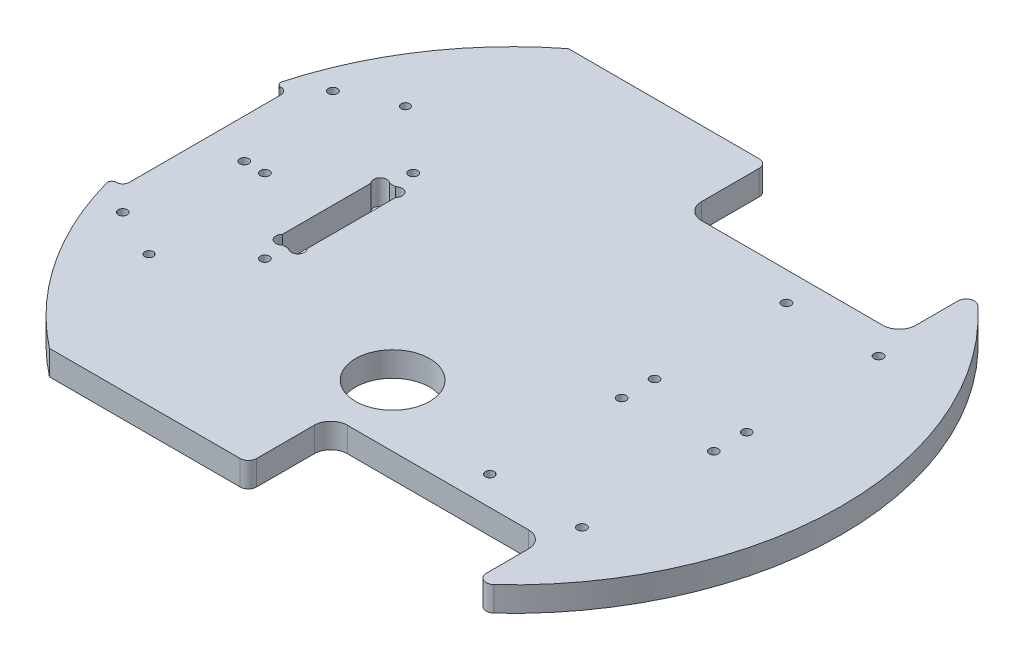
ISO-10303-21;
HEADER;
FILE_DESCRIPTION(('STEP AP214'),'2;1');
FILE_NAME('part.step','',(''),(''),'','','');
FILE_SCHEMA(('AUTOMOTIVE_DESIGN { 1 0 10303 214 1 1 1 1 }'));
ENDSEC;
DATA;
#1=APPLICATION_CONTEXT('core data for automotive mechanical design processes');
#2=APPLICATION_PROTOCOL_DEFINITION('international standard','automotive_design',2000,#1);
#3=PRODUCT_CONTEXT('',#1,'mechanical');
#4=PRODUCT('Part','Part','',(#3));
#5=PRODUCT_RELATED_PRODUCT_CATEGORY('part','',(#4));
#6=PRODUCT_DEFINITION_FORMATION('','',#4);
#7=PRODUCT_DEFINITION_CONTEXT('part definition',#1,'design');
#8=PRODUCT_DEFINITION('design','',#6,#7);
#9=PRODUCT_DEFINITION_SHAPE('','',#8);
#10=(LENGTH_UNIT() NAMED_UNIT(*) SI_UNIT(.MILLI.,.METRE.));
#11=(NAMED_UNIT(*) PLANE_ANGLE_UNIT() SI_UNIT($,.RADIAN.));
#12=(NAMED_UNIT(*) SI_UNIT($,.STERADIAN.) SOLID_ANGLE_UNIT());
#13=UNCERTAINTY_MEASURE_WITH_UNIT(LENGTH_MEASURE(1.E-05),#10,'distance_accuracy_value','');
#14=(GEOMETRIC_REPRESENTATION_CONTEXT(3) GLOBAL_UNCERTAINTY_ASSIGNED_CONTEXT((#13)) GLOBAL_UNIT_ASSIGNED_CONTEXT((#10,
#11,#12)) REPRESENTATION_CONTEXT('',''));
#15=CARTESIAN_POINT('',(0.,0.,0.));
#16=DIRECTION('',(0.,0.,1.));
#17=DIRECTION('',(1.,0.,0.));
#18=AXIS2_PLACEMENT_3D('',#15,#16,#17);
#19=CARTESIAN_POINT('',(-15.,6.,0.));
#20=DIRECTION('',(0.,1.,0.));
#21=DIRECTION('',(0.,0.,1.));
#22=AXIS2_PLACEMENT_3D('',#19,#20,#21);
#23=PLANE('',#22);
#24=CARTESIAN_POINT('',(-57.0000000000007,6.,18.));
#25=DIRECTION('',(0.,1.,0.));
#26=DIRECTION('',(0.,0.,-1.));
#27=AXIS2_PLACEMENT_3D('',#24,#25,#26);
#28=CIRCLE('',#27,1.1);
#29=CARTESIAN_POINT('',(-57.0000000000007,6.,16.9));
#30=VERTEX_POINT('',#29);
#31=EDGE_CURVE('E291',#30,#30,#28,.T.);
#32=ORIENTED_EDGE('',*,*,#31,.F.);
#33=EDGE_LOOP('',(#32));
#34=FACE_BOUND('',#33,.T.);
#35=CARTESIAN_POINT('',(-57.0000000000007,6.,-18.));
#36=DIRECTION('',(0.,1.,0.));
#37=DIRECTION('',(0.,0.,1.));
#38=AXIS2_PLACEMENT_3D('',#35,#36,#37);
#39=CIRCLE('',#38,1.1);
#40=CARTESIAN_POINT('',(-57.0000000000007,6.,-16.9));
#41=VERTEX_POINT('',#40);
#42=EDGE_CURVE('E321',#41,#41,#39,.T.);
#43=ORIENTED_EDGE('',*,*,#42,.F.);
#44=EDGE_LOOP('',(#43));
#45=FACE_BOUND('',#44,.T.);
#46=CARTESIAN_POINT('',(-80.,6.,0.));
#47=DIRECTION('',(0.,1.,0.));
#48=DIRECTION('',(0.,0.,1.));
#49=AXIS2_PLACEMENT_3D('',#46,#47,#48);
#50=CIRCLE('',#49,1.10000000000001);
#51=CARTESIAN_POINT('',(-80.,6.,1.10000000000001));
#52=VERTEX_POINT('',#51);
#53=EDGE_CURVE('E333',#52,#52,#50,.T.);
#54=ORIENTED_EDGE('',*,*,#53,.F.);
#55=EDGE_LOOP('',(#54));
#56=FACE_BOUND('',#55,.T.);
#57=CARTESIAN_POINT('',(-84.0000000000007,6.,25.5));
#58=DIRECTION('',(0.,1.,0.));
#59=DIRECTION('',(0.,0.,-1.));
#60=AXIS2_PLACEMENT_3D('',#57,#58,#59);
#61=CIRCLE('',#60,1.10000000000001);
#62=CARTESIAN_POINT('',(-84.0000000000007,6.,24.4));
#63=VERTEX_POINT('',#62);
#64=EDGE_CURVE('E345',#63,#63,#61,.T.);
#65=ORIENTED_EDGE('',*,*,#64,.F.);
#66=EDGE_LOOP('',(#65));
#67=FACE_BOUND('',#66,.T.);
#68=CARTESIAN_POINT('',(15.6,6.,-36.));
#69=DIRECTION('',(0.,1.,0.));
#70=DIRECTION('',(0.,0.,1.));
#71=AXIS2_PLACEMENT_3D('',#68,#69,#70);
#72=CIRCLE('',#71,1.09999999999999);
#73=CARTESIAN_POINT('',(15.6,6.,-34.9));
#74=VERTEX_POINT('',#73);
#75=EDGE_CURVE('E357',#74,#74,#72,.T.);
#76=ORIENTED_EDGE('',*,*,#75,.F.);
#77=EDGE_LOOP('',(#76));
#78=FACE_BOUND('',#77,.T.);
#79=CARTESIAN_POINT('',(15.6,6.,36.));
#80=DIRECTION('',(0.,1.,0.));
#81=DIRECTION('',(0.,0.,-1.));
#82=AXIS2_PLACEMENT_3D('',#79,#80,#81);
#83=CIRCLE('',#82,1.09999999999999);
#84=CARTESIAN_POINT('',(15.6,6.,34.9));
#85=VERTEX_POINT('',#84);
#86=EDGE_CURVE('E369',#85,#85,#83,.T.);
#87=ORIENTED_EDGE('',*,*,#86,.F.);
#88=EDGE_LOOP('',(#87));
#89=FACE_BOUND('',#88,.T.);
#90=CARTESIAN_POINT('',(37.9590359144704,6.,4.));
#91=DIRECTION('',(0.,1.,0.));
#92=DIRECTION('',(0.,0.,1.));
#93=AXIS2_PLACEMENT_3D('',#90,#91,#92);
#94=CIRCLE('',#93,1.1);
#95=CARTESIAN_POINT('',(37.9590359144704,6.,5.1));
#96=VERTEX_POINT('',#95);
#97=EDGE_CURVE('E381',#96,#96,#94,.T.);
#98=ORIENTED_EDGE('',*,*,#97,.F.);
#99=EDGE_LOOP('',(#98));
#100=FACE_BOUND('',#99,.T.);
#101=CARTESIAN_POINT('',(37.9590359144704,6.,-4.));
#102=DIRECTION('',(0.,1.,0.));
#103=DIRECTION('',(0.,0.,-1.));
#104=AXIS2_PLACEMENT_3D('',#101,#102,#103);
#105=CIRCLE('',#104,1.1);
#106=CARTESIAN_POINT('',(37.9590359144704,6.,-5.1));
#107=VERTEX_POINT('',#106);
#108=EDGE_CURVE('E393',#107,#107,#105,.T.);
#109=ORIENTED_EDGE('',*,*,#108,.F.);
#110=EDGE_LOOP('',(#109));
#111=FACE_BOUND('',#110,.T.);
#112=CARTESIAN_POINT('',(-84.0000000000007,6.,-25.5));
#113=DIRECTION('',(0.,1.,0.));
#114=DIRECTION('',(0.,0.,1.));
#115=AXIS2_PLACEMENT_3D('',#112,#113,#114);
#116=CIRCLE('',#115,1.10000000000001);
#117=CARTESIAN_POINT('',(-84.0000000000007,6.,-24.4));
#118=VERTEX_POINT('',#117);
#119=EDGE_CURVE('E405',#118,#118,#116,.T.);
#120=ORIENTED_EDGE('',*,*,#119,.F.);
#121=EDGE_LOOP('',(#120));
#122=FACE_BOUND('',#121,.T.);
#123=CARTESIAN_POINT('',(-15.,6.,0.));
#124=DIRECTION('',(0.,1.,0.));
#125=DIRECTION('',(0.,0.,1.));
#126=AXIS2_PLACEMENT_3D('',#123,#124,#125);
#127=CIRCLE('',#126,79.9999999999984);
#128=CARTESIAN_POINT('',(-92.1217529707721,6.,21.26582278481));
#129=VERTEX_POINT('',#128);
#130=CARTESIAN_POINT('',(-64.3051721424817,6.,63.));
#131=VERTEX_POINT('',#130);
#132=EDGE_CURVE('E411',#129,#131,#127,.T.);
#133=ORIENTED_EDGE('',*,*,#132,.T.);
#134=DIRECTION('',(1.,0.,0.));
#135=VECTOR('',#134,1.);
#136=CARTESIAN_POINT('',(-64.3051721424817,6.,63.));
#137=LINE('',#136,#135);
#138=CARTESIAN_POINT('',(-18.0000000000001,6.,63.));
#139=VERTEX_POINT('',#138);
#140=EDGE_CURVE('E414',#131,#139,#137,.T.);
#141=ORIENTED_EDGE('',*,*,#140,.T.);
#142=CARTESIAN_POINT('',(-18.,6.,61.));
#143=DIRECTION('',(0.,1.,0.));
#144=DIRECTION('',(0.,0.,1.));
#145=AXIS2_PLACEMENT_3D('',#142,#143,#144);
#146=CIRCLE('',#145,1.99999999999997);
#147=CARTESIAN_POINT('',(-16.,6.,61.));
#148=VERTEX_POINT('',#147);
#149=EDGE_CURVE('E417',#139,#148,#146,.T.);
#150=ORIENTED_EDGE('',*,*,#149,.T.);
#151=DIRECTION('',(0.,0.,-1.));
#152=VECTOR('',#151,1.);
#153=CARTESIAN_POINT('',(-16.0000000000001,6.,61.));
#154=LINE('',#153,#152);
#155=CARTESIAN_POINT('',(-15.9999999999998,6.,46.9999999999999));
#156=VERTEX_POINT('',#155);
#157=EDGE_CURVE('E419',#148,#156,#154,.T.);
#158=ORIENTED_EDGE('',*,*,#157,.T.);
#159=CARTESIAN_POINT('',(-12.,6.,47.));
#160=DIRECTION('',(0.,-1.,0.));
#161=DIRECTION('',(0.,0.,-1.));
#162=AXIS2_PLACEMENT_3D('',#159,#160,#161);
#163=CIRCLE('',#162,3.99999999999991);
#164=CARTESIAN_POINT('',(-11.9999999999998,6.,43.0000000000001));
#165=VERTEX_POINT('',#164);
#166=EDGE_CURVE('E421',#156,#165,#163,.T.);
#167=ORIENTED_EDGE('',*,*,#166,.T.);
#168=DIRECTION('',(1.,0.,0.));
#169=VECTOR('',#168,1.);
#170=CARTESIAN_POINT('',(-11.9999999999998,6.,43.));
#171=LINE('',#170,#169);
#172=CARTESIAN_POINT('',(32.0000000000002,6.,43.));
#173=VERTEX_POINT('',#172);
#174=EDGE_CURVE('E423',#165,#173,#171,.T.);
#175=ORIENTED_EDGE('',*,*,#174,.T.);
#176=CARTESIAN_POINT('',(32.,6.,47.));
#177=DIRECTION('',(0.,-1.,0.));
#178=DIRECTION('',(0.,0.,-1.));
#179=AXIS2_PLACEMENT_3D('',#176,#177,#178);
#180=CIRCLE('',#179,4.00000000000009);
#181=CARTESIAN_POINT('',(36.0000000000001,6.,47.0000000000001));
#182=VERTEX_POINT('',#181);
#183=EDGE_CURVE('E425',#173,#182,#180,.T.);
#184=ORIENTED_EDGE('',*,*,#183,.T.);
#185=DIRECTION('',(0.,0.,1.));
#186=VECTOR('',#185,1.);
#187=CARTESIAN_POINT('',(36.,6.,57.2276157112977));
#188=LINE('',#187,#186);
#189=CARTESIAN_POINT('',(36.,6.,57.2276157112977));
#190=VERTEX_POINT('',#189);
#191=EDGE_CURVE('E427',#182,#190,#188,.T.);
#192=ORIENTED_EDGE('',*,*,#191,.T.);
#193=CARTESIAN_POINT('',(38.,6.,57.227615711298));
#194=DIRECTION('',(0.,1.,0.));
#195=DIRECTION('',(0.,0.,1.));
#196=AXIS2_PLACEMENT_3D('',#193,#194,#195);
#197=CIRCLE('',#196,2.);
#198=CARTESIAN_POINT('',(39.3589743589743,6.,58.6949904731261));
#199=VERTEX_POINT('',#198);
#200=EDGE_CURVE('E429',#190,#199,#197,.T.);
#201=ORIENTED_EDGE('',*,*,#200,.T.);
#202=CARTESIAN_POINT('',(-15.,6.,0.));
#203=DIRECTION('',(0.,1.,0.));
#204=DIRECTION('',(0.,0.,1.));
#205=AXIS2_PLACEMENT_3D('',#202,#203,#204);
#206=CIRCLE('',#205,79.9999999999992);
#207=CARTESIAN_POINT('',(39.3589743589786,6.,-58.6949904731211));
#208=VERTEX_POINT('',#207);
#209=EDGE_CURVE('E431',#199,#208,#206,.T.);
#210=ORIENTED_EDGE('',*,*,#209,.T.);
#211=CARTESIAN_POINT('',(38.0000000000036,6.,-57.2276157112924));
#212=DIRECTION('',(0.,1.,0.));
#213=DIRECTION('',(0.,0.,1.));
#214=AXIS2_PLACEMENT_3D('',#211,#212,#213);
#215=CIRCLE('',#214,2.);
#216=CARTESIAN_POINT('',(36.0000000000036,6.,-57.227615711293));
#217=VERTEX_POINT('',#216);
#218=EDGE_CURVE('E433',#208,#217,#215,.T.);
#219=ORIENTED_EDGE('',*,*,#218,.T.);
#220=DIRECTION('',(-3.07336433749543E-13,0.,1.));
#221=VECTOR('',#220,1.);
#222=CARTESIAN_POINT('',(36.0000000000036,6.,-57.227615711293));
#223=LINE('',#222,#221);
#224=CARTESIAN_POINT('',(36.0000000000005,6.,-46.9999999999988));
#225=VERTEX_POINT('',#224);
#226=EDGE_CURVE('E435',#217,#225,#223,.T.);
#227=ORIENTED_EDGE('',*,*,#226,.T.);
#228=CARTESIAN_POINT('',(32.,6.,-47.));
#229=DIRECTION('',(0.,-1.,0.));
#230=DIRECTION('',(0.,0.,-1.));
#231=AXIS2_PLACEMENT_3D('',#228,#229,#230);
#232=CIRCLE('',#231,4.00000000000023);
#233=CARTESIAN_POINT('',(32.0000000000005,6.,-42.9999999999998));
#234=VERTEX_POINT('',#233);
#235=EDGE_CURVE('E437',#225,#234,#232,.T.);
#236=ORIENTED_EDGE('',*,*,#235,.T.);
#237=DIRECTION('',(-1.,0.,0.));
#238=VECTOR('',#237,1.);
#239=CARTESIAN_POINT('',(-12.,6.,-43.));
#240=LINE('',#239,#238);
#241=CARTESIAN_POINT('',(-12.,6.,-43.));
#242=VERTEX_POINT('',#241);
#243=EDGE_CURVE('E439',#234,#242,#240,.T.);
#244=ORIENTED_EDGE('',*,*,#243,.T.);
#245=CARTESIAN_POINT('',(-12.,6.,-47.));
#246=DIRECTION('',(0.,-1.,0.));
#247=DIRECTION('',(0.,0.,-1.));
#248=AXIS2_PLACEMENT_3D('',#245,#246,#247);
#249=CIRCLE('',#248,4.);
#250=CARTESIAN_POINT('',(-16.,6.,-47.));
#251=VERTEX_POINT('',#250);
#252=EDGE_CURVE('E441',#242,#251,#249,.T.);
#253=ORIENTED_EDGE('',*,*,#252,.T.);
#254=DIRECTION('',(0.,0.,-1.));
#255=VECTOR('',#254,1.);
#256=CARTESIAN_POINT('',(-16.0000000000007,6.,-61.));
#257=LINE('',#256,#255);
#258=CARTESIAN_POINT('',(-16.0000000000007,6.,-61.));
#259=VERTEX_POINT('',#258);
#260=EDGE_CURVE('E443',#251,#259,#257,.T.);
#261=ORIENTED_EDGE('',*,*,#260,.T.);
#262=CARTESIAN_POINT('',(-18.,6.,-61.));
#263=DIRECTION('',(0.,1.,0.));
#264=DIRECTION('',(0.,0.,1.));
#265=AXIS2_PLACEMENT_3D('',#262,#263,#264);
#266=CIRCLE('',#265,1.99999999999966);
#267=CARTESIAN_POINT('',(-18.0000000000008,6.,-62.9999999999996));
#268=VERTEX_POINT('',#267);
#269=EDGE_CURVE('E445',#259,#268,#266,.T.);
#270=ORIENTED_EDGE('',*,*,#269,.T.);
#271=DIRECTION('',(-1.,0.,0.));
#272=VECTOR('',#271,1.);
#273=CARTESIAN_POINT('',(-64.3051721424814,6.,-63.0000000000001));
#274=LINE('',#273,#272);
#275=CARTESIAN_POINT('',(-64.3051721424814,6.,-63.0000000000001));
#276=VERTEX_POINT('',#275);
#277=EDGE_CURVE('E447',#268,#276,#274,.T.);
#278=ORIENTED_EDGE('',*,*,#277,.T.);
#279=CARTESIAN_POINT('',(-15.,6.,0.));
#280=DIRECTION('',(0.,1.,0.));
#281=DIRECTION('',(0.,0.,1.));
#282=AXIS2_PLACEMENT_3D('',#279,#280,#281);
#283=CIRCLE('',#282,79.9999999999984);
#284=CARTESIAN_POINT('',(-92.1217529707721,6.,-21.2658227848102));
#285=VERTEX_POINT('',#284);
#286=EDGE_CURVE('E449',#276,#285,#283,.T.);
#287=ORIENTED_EDGE('',*,*,#286,.T.);
#288=CARTESIAN_POINT('',(-91.1577310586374,6.,-21.));
#289=DIRECTION('',(0.,1.,0.));
#290=DIRECTION('',(0.,0.,-1.));
#291=AXIS2_PLACEMENT_3D('',#288,#289,#290);
#292=CIRCLE('',#291,1.00000000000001);
#293=CARTESIAN_POINT('',(-91.1577310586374,6.,-20.));
#294=VERTEX_POINT('',#293);
#295=EDGE_CURVE('E451',#285,#294,#292,.T.);
#296=ORIENTED_EDGE('',*,*,#295,.T.);
#297=DIRECTION('',(1.,0.,0.));
#298=VECTOR('',#297,1.);
#299=CARTESIAN_POINT('',(-91.1577310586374,6.,-20.));
#300=LINE('',#299,#298);
#301=CARTESIAN_POINT('',(-91.1000000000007,6.,-20.));
#302=VERTEX_POINT('',#301);
#303=EDGE_CURVE('E453',#294,#302,#300,.T.);
#304=ORIENTED_EDGE('',*,*,#303,.T.);
#305=CARTESIAN_POINT('',(-91.1000000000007,6.,-18.4));
#306=DIRECTION('',(0.,-1.,0.));
#307=DIRECTION('',(0.,0.,-1.));
#308=AXIS2_PLACEMENT_3D('',#305,#306,#307);
#309=CIRCLE('',#308,1.6);
#310=CARTESIAN_POINT('',(-89.5000000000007,6.,-18.4));
#311=VERTEX_POINT('',#310);
#312=EDGE_CURVE('E455',#302,#311,#309,.T.);
#313=ORIENTED_EDGE('',*,*,#312,.T.);
#314=DIRECTION('',(0.,0.,1.));
#315=VECTOR('',#314,1.);
#316=CARTESIAN_POINT('',(-89.5000000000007,6.,-18.4));
#317=LINE('',#316,#315);
#318=CARTESIAN_POINT('',(-89.5000000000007,6.,18.3999999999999));
#319=VERTEX_POINT('',#318);
#320=EDGE_CURVE('E457',#311,#319,#317,.T.);
#321=ORIENTED_EDGE('',*,*,#320,.T.);
#322=CARTESIAN_POINT('',(-91.1000000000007,6.,18.4));
#323=DIRECTION('',(0.,-1.,0.));
#324=DIRECTION('',(0.,0.,1.));
#325=AXIS2_PLACEMENT_3D('',#322,#323,#324);
#326=CIRCLE('',#325,1.59999999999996);
#327=CARTESIAN_POINT('',(-91.1000000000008,6.,20.));
#328=VERTEX_POINT('',#327);
#329=EDGE_CURVE('E459',#319,#328,#326,.T.);
#330=ORIENTED_EDGE('',*,*,#329,.T.);
#331=DIRECTION('',(-1.,0.,0.));
#332=VECTOR('',#331,1.);
#333=CARTESIAN_POINT('',(-91.1577310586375,6.,19.9999999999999));
#334=LINE('',#333,#332);
#335=CARTESIAN_POINT('',(-91.1577310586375,6.,19.9999999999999));
#336=VERTEX_POINT('',#335);
#337=EDGE_CURVE('E461',#328,#336,#334,.T.);
#338=ORIENTED_EDGE('',*,*,#337,.T.);
#339=CARTESIAN_POINT('',(-91.1577310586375,6.,20.9999999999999));
#340=DIRECTION('',(0.,1.,0.));
#341=DIRECTION('',(0.,0.,1.));
#342=AXIS2_PLACEMENT_3D('',#339,#340,#341);
#343=CIRCLE('',#342,0.999999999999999);
#344=EDGE_CURVE('E463',#336,#129,#343,.T.);
#345=ORIENTED_EDGE('',*,*,#344,.T.);
#346=EDGE_LOOP('',(#133,#141,#150,#158,#167,#175,#184,#192,#201,#210,#219,#227,#236,#244,#253,
#261,#270,#278,#287,#296,#304,#313,#321,#330,#338,#345));
#347=FACE_BOUND('',#346,.T.);
#348=CARTESIAN_POINT('',(-16.0000000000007,6.,28.));
#349=DIRECTION('',(0.,1.,0.));
#350=DIRECTION('',(0.,0.,1.));
#351=AXIS2_PLACEMENT_3D('',#348,#349,#350);
#352=CIRCLE('',#351,9.);
#353=CARTESIAN_POINT('',(-16.0000000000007,6.,37.));
#354=VERTEX_POINT('',#353);
#355=EDGE_CURVE('E399',#354,#354,#352,.T.);
#356=ORIENTED_EDGE('',*,*,#355,.F.);
#357=EDGE_LOOP('',(#356));
#358=FACE_BOUND('',#357,.T.);
#359=CARTESIAN_POINT('',(15.6,6.,4.));
#360=DIRECTION('',(0.,1.,0.));
#361=DIRECTION('',(0.,0.,1.));
#362=AXIS2_PLACEMENT_3D('',#359,#360,#361);
#363=CIRCLE('',#362,1.1);
#364=CARTESIAN_POINT('',(15.6,6.,5.1));
#365=VERTEX_POINT('',#364);
#366=EDGE_CURVE('E387',#365,#365,#363,.T.);
#367=ORIENTED_EDGE('',*,*,#366,.F.);
#368=EDGE_LOOP('',(#367));
#369=FACE_BOUND('',#368,.T.);
#370=CARTESIAN_POINT('',(37.9590359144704,6.,36.));
#371=DIRECTION('',(0.,1.,0.));
#372=DIRECTION('',(0.,0.,-1.));
#373=AXIS2_PLACEMENT_3D('',#370,#371,#372);
#374=CIRCLE('',#373,1.1);
#375=CARTESIAN_POINT('',(37.9590359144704,6.,34.9));
#376=VERTEX_POINT('',#375);
#377=EDGE_CURVE('E375',#376,#376,#374,.T.);
#378=ORIENTED_EDGE('',*,*,#377,.F.);
#379=EDGE_LOOP('',(#378));
#380=FACE_BOUND('',#379,.T.);
#381=CARTESIAN_POINT('',(37.9590359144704,6.,-36.));
#382=DIRECTION('',(0.,1.,0.));
#383=DIRECTION('',(0.,0.,1.));
#384=AXIS2_PLACEMENT_3D('',#381,#382,#383);
#385=CIRCLE('',#384,1.1);
#386=CARTESIAN_POINT('',(37.9590359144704,6.,-34.9));
#387=VERTEX_POINT('',#386);
#388=EDGE_CURVE('E363',#387,#387,#385,.T.);
#389=ORIENTED_EDGE('',*,*,#388,.F.);
#390=EDGE_LOOP('',(#389));
#391=FACE_BOUND('',#390,.T.);
#392=CARTESIAN_POINT('',(15.6,6.,-4.));
#393=DIRECTION('',(0.,1.,0.));
#394=DIRECTION('',(0.,0.,-1.));
#395=AXIS2_PLACEMENT_3D('',#392,#393,#394);
#396=CIRCLE('',#395,1.1);
#397=CARTESIAN_POINT('',(15.6,6.,-5.1));
#398=VERTEX_POINT('',#397);
#399=EDGE_CURVE('E351',#398,#398,#396,.T.);
#400=ORIENTED_EDGE('',*,*,#399,.F.);
#401=EDGE_LOOP('',(#400));
#402=FACE_BOUND('',#401,.T.);
#403=CARTESIAN_POINT('',(-72.,6.,31.1));
#404=DIRECTION('',(0.,1.,0.));
#405=DIRECTION('',(0.,0.,-1.));
#406=AXIS2_PLACEMENT_3D('',#403,#404,#405);
#407=CIRCLE('',#406,1.04999999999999);
#408=CARTESIAN_POINT('',(-72.,6.,30.05));
#409=VERTEX_POINT('',#408);
#410=EDGE_CURVE('E339',#409,#409,#407,.T.);
#411=ORIENTED_EDGE('',*,*,#410,.F.);
#412=EDGE_LOOP('',(#411));
#413=FACE_BOUND('',#412,.T.);
#414=CARTESIAN_POINT('',(-72.,6.,-31.1));
#415=DIRECTION('',(0.,1.,0.));
#416=DIRECTION('',(0.,0.,1.));
#417=AXIS2_PLACEMENT_3D('',#414,#415,#416);
#418=CIRCLE('',#417,1.04999999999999);
#419=CARTESIAN_POINT('',(-72.,6.,-30.05));
#420=VERTEX_POINT('',#419);
#421=EDGE_CURVE('E327',#420,#420,#418,.T.);
#422=ORIENTED_EDGE('',*,*,#421,.F.);
#423=EDGE_LOOP('',(#422));
#424=FACE_BOUND('',#423,.T.);
#425=DIRECTION('',(-1.,0.,0.));
#426=VECTOR('',#425,1.);
#427=CARTESIAN_POINT('',(-57.7372583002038,6.,-13.));
#428=LINE('',#427,#426);
#429=CARTESIAN_POINT('',(-56.2627416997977,6.,-13.));
#430=VERTEX_POINT('',#429);
#431=CARTESIAN_POINT('',(-57.7372583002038,6.,-13.));
#432=VERTEX_POINT('',#431);
#433=EDGE_CURVE('E261',#430,#432,#428,.T.);
#434=ORIENTED_EDGE('',*,*,#433,.F.);
#435=CARTESIAN_POINT('',(-55.1313708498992,6.,-11.8686291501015));
#436=DIRECTION('',(0.,1.,0.));
#437=DIRECTION('',(0.,0.,1.));
#438=AXIS2_PLACEMENT_3D('',#435,#436,#437);
#439=CIRCLE('',#438,1.6);
#440=CARTESIAN_POINT('',(-54.0000000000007,6.,-10.7372583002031));
#441=VERTEX_POINT('',#440);
#442=EDGE_CURVE('E253',#441,#430,#439,.T.);
#443=ORIENTED_EDGE('',*,*,#442,.F.);
#444=DIRECTION('',(0.,0.,-1.));
#445=VECTOR('',#444,1.);
#446=CARTESIAN_POINT('',(-54.0000000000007,6.,-10.7372583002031));
#447=LINE('',#446,#445);
#448=CARTESIAN_POINT('',(-54.0000000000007,6.,10.7372583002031));
#449=VERTEX_POINT('',#448);
#450=EDGE_CURVE('E288',#449,#441,#447,.T.);
#451=ORIENTED_EDGE('',*,*,#450,.F.);
#452=CARTESIAN_POINT('',(-55.1313708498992,6.,11.8686291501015));
#453=DIRECTION('',(0.,1.,0.));
#454=DIRECTION('',(0.,0.,-1.));
#455=AXIS2_PLACEMENT_3D('',#452,#453,#454);
#456=CIRCLE('',#455,1.6);
#457=CARTESIAN_POINT('',(-56.2627416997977,6.,13.));
#458=VERTEX_POINT('',#457);
#459=EDGE_CURVE('E286',#458,#449,#456,.T.);
#460=ORIENTED_EDGE('',*,*,#459,.F.);
#461=DIRECTION('',(1.,0.,0.));
#462=VECTOR('',#461,1.);
#463=CARTESIAN_POINT('',(-57.7372583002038,6.,13.));
#464=LINE('',#463,#462);
#465=CARTESIAN_POINT('',(-57.7372583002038,6.,13.));
#466=VERTEX_POINT('',#465);
#467=EDGE_CURVE('E284',#466,#458,#464,.T.);
#468=ORIENTED_EDGE('',*,*,#467,.F.);
#469=CARTESIAN_POINT('',(-58.8686291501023,6.,11.8686291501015));
#470=DIRECTION('',(0.,1.,0.));
#471=DIRECTION('',(0.,0.,1.));
#472=AXIS2_PLACEMENT_3D('',#469,#470,#471);
#473=CIRCLE('',#472,1.6);
#474=CARTESIAN_POINT('',(-60.0000000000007,6.,10.7372583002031));
#475=VERTEX_POINT('',#474);
#476=EDGE_CURVE('E282',#475,#466,#473,.T.);
#477=ORIENTED_EDGE('',*,*,#476,.F.);
#478=DIRECTION('',(0.,0.,1.));
#479=VECTOR('',#478,1.);
#480=CARTESIAN_POINT('',(-60.0000000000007,6.,-10.7372583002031));
#481=LINE('',#480,#479);
#482=CARTESIAN_POINT('',(-60.0000000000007,6.,-10.7372583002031));
#483=VERTEX_POINT('',#482);
#484=EDGE_CURVE('E277',#483,#475,#481,.T.);
#485=ORIENTED_EDGE('',*,*,#484,.F.);
#486=CARTESIAN_POINT('',(-58.8686291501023,6.,-11.8686291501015));
#487=DIRECTION('',(0.,1.,0.));
#488=DIRECTION('',(0.,0.,-1.));
#489=AXIS2_PLACEMENT_3D('',#486,#487,#488);
#490=CIRCLE('',#489,1.6);
#491=EDGE_CURVE('E275',#432,#483,#490,.T.);
#492=ORIENTED_EDGE('',*,*,#491,.F.);
#493=EDGE_LOOP('',(#434,#443,#451,#460,#468,#477,#485,#492));
#494=FACE_BOUND('',#493,.T.);
#495=CARTESIAN_POINT('',(-75.,6.,0.));
#496=DIRECTION('',(0.,1.,0.));
#497=DIRECTION('',(0.,0.,1.));
#498=AXIS2_PLACEMENT_3D('',#495,#496,#497);
#499=CIRCLE('',#498,1.10000000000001);
#500=CARTESIAN_POINT('',(-75.,6.,1.10000000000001));
#501=VERTEX_POINT('',#500);
#502=EDGE_CURVE('E1194',#501,#501,#499,.T.);
#503=ORIENTED_EDGE('',*,*,#502,.F.);
#504=EDGE_LOOP('',(#503));
#505=FACE_BOUND('',#504,.T.);
#506=ADVANCED_FACE('F32',(#34,#45,#56,#67,#78,#89,#100,#111,#122,#347,#358,#369,#380,#391,#402,
#413,#424,#494,#505),#23,.T.);
#507=CARTESIAN_POINT('',(-15.,0.,0.));
#508=DIRECTION('',(0.,1.,0.));
#509=DIRECTION('',(0.,0.,1.));
#510=AXIS2_PLACEMENT_3D('',#507,#508,#509);
#511=PLANE('',#510);
#512=CARTESIAN_POINT('',(-57.0000000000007,0.,18.));
#513=DIRECTION('',(0.,1.,0.));
#514=DIRECTION('',(0.,0.,-1.));
#515=AXIS2_PLACEMENT_3D('',#512,#513,#514);
#516=CIRCLE('',#515,1.1);
#517=CARTESIAN_POINT('',(-57.0000000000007,0.,16.9));
#518=VERTEX_POINT('',#517);
#519=EDGE_CURVE('E1200',#518,#518,#516,.T.);
#520=ORIENTED_EDGE('',*,*,#519,.T.);
#521=EDGE_LOOP('',(#520));
#522=FACE_BOUND('',#521,.T.);
#523=CARTESIAN_POINT('',(-57.0000000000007,0.,-18.));
#524=DIRECTION('',(0.,1.,0.));
#525=DIRECTION('',(0.,0.,1.));
#526=AXIS2_PLACEMENT_3D('',#523,#524,#525);
#527=CIRCLE('',#526,1.1);
#528=CARTESIAN_POINT('',(-57.0000000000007,0.,-16.9));
#529=VERTEX_POINT('',#528);
#530=EDGE_CURVE('E269',#529,#529,#527,.T.);
#531=ORIENTED_EDGE('',*,*,#530,.T.);
#532=EDGE_LOOP('',(#531));
#533=FACE_BOUND('',#532,.T.);
#534=CARTESIAN_POINT('',(-80.,0.,0.));
#535=DIRECTION('',(0.,1.,0.));
#536=DIRECTION('',(0.,0.,1.));
#537=AXIS2_PLACEMENT_3D('',#534,#535,#536);
#538=CIRCLE('',#537,1.10000000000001);
#539=CARTESIAN_POINT('',(-80.,0.,1.10000000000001));
#540=VERTEX_POINT('',#539);
#541=EDGE_CURVE('E330',#540,#540,#538,.T.);
#542=ORIENTED_EDGE('',*,*,#541,.T.);
#543=EDGE_LOOP('',(#542));
#544=FACE_BOUND('',#543,.T.);
#545=CARTESIAN_POINT('',(-84.0000000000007,0.,25.5));
#546=DIRECTION('',(0.,1.,0.));
#547=DIRECTION('',(0.,0.,-1.));
#548=AXIS2_PLACEMENT_3D('',#545,#546,#547);
#549=CIRCLE('',#548,1.10000000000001);
#550=CARTESIAN_POINT('',(-84.0000000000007,0.,24.4));
#551=VERTEX_POINT('',#550);
#552=EDGE_CURVE('E342',#551,#551,#549,.T.);
#553=ORIENTED_EDGE('',*,*,#552,.T.);
#554=EDGE_LOOP('',(#553));
#555=FACE_BOUND('',#554,.T.);
#556=CARTESIAN_POINT('',(15.6,0.,-36.));
#557=DIRECTION('',(0.,1.,0.));
#558=DIRECTION('',(0.,0.,1.));
#559=AXIS2_PLACEMENT_3D('',#556,#557,#558);
#560=CIRCLE('',#559,1.09999999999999);
#561=CARTESIAN_POINT('',(15.6,0.,-34.9));
#562=VERTEX_POINT('',#561);
#563=EDGE_CURVE('E354',#562,#562,#560,.T.);
#564=ORIENTED_EDGE('',*,*,#563,.T.);
#565=EDGE_LOOP('',(#564));
#566=FACE_BOUND('',#565,.T.);
#567=CARTESIAN_POINT('',(15.6,0.,36.));
#568=DIRECTION('',(0.,1.,0.));
#569=DIRECTION('',(0.,0.,-1.));
#570=AXIS2_PLACEMENT_3D('',#567,#568,#569);
#571=CIRCLE('',#570,1.09999999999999);
#572=CARTESIAN_POINT('',(15.6,0.,34.9));
#573=VERTEX_POINT('',#572);
#574=EDGE_CURVE('E366',#573,#573,#571,.T.);
#575=ORIENTED_EDGE('',*,*,#574,.T.);
#576=EDGE_LOOP('',(#575));
#577=FACE_BOUND('',#576,.T.);
#578=CARTESIAN_POINT('',(37.9590359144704,0.,4.));
#579=DIRECTION('',(0.,1.,0.));
#580=DIRECTION('',(0.,0.,1.));
#581=AXIS2_PLACEMENT_3D('',#578,#579,#580);
#582=CIRCLE('',#581,1.1);
#583=CARTESIAN_POINT('',(37.9590359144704,0.,5.1));
#584=VERTEX_POINT('',#583);
#585=EDGE_CURVE('E378',#584,#584,#582,.T.);
#586=ORIENTED_EDGE('',*,*,#585,.T.);
#587=EDGE_LOOP('',(#586));
#588=FACE_BOUND('',#587,.T.);
#589=CARTESIAN_POINT('',(37.9590359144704,0.,-4.));
#590=DIRECTION('',(0.,1.,0.));
#591=DIRECTION('',(0.,0.,-1.));
#592=AXIS2_PLACEMENT_3D('',#589,#590,#591);
#593=CIRCLE('',#592,1.1);
#594=CARTESIAN_POINT('',(37.9590359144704,0.,-5.1));
#595=VERTEX_POINT('',#594);
#596=EDGE_CURVE('E390',#595,#595,#593,.T.);
#597=ORIENTED_EDGE('',*,*,#596,.T.);
#598=EDGE_LOOP('',(#597));
#599=FACE_BOUND('',#598,.T.);
#600=CARTESIAN_POINT('',(-84.0000000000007,0.,-25.5));
#601=DIRECTION('',(0.,1.,0.));
#602=DIRECTION('',(0.,0.,1.));
#603=AXIS2_PLACEMENT_3D('',#600,#601,#602);
#604=CIRCLE('',#603,1.10000000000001);
#605=CARTESIAN_POINT('',(-84.0000000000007,0.,-24.4));
#606=VERTEX_POINT('',#605);
#607=EDGE_CURVE('E402',#606,#606,#604,.T.);
#608=ORIENTED_EDGE('',*,*,#607,.T.);
#609=EDGE_LOOP('',(#608));
#610=FACE_BOUND('',#609,.T.);
#611=CARTESIAN_POINT('',(-15.,0.,0.));
#612=DIRECTION('',(0.,1.,0.));
#613=DIRECTION('',(0.,0.,1.));
#614=AXIS2_PLACEMENT_3D('',#611,#612,#613);
#615=CIRCLE('',#614,79.9999999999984);
#616=CARTESIAN_POINT('',(-92.1217529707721,0.,21.26582278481));
#617=VERTEX_POINT('',#616);
#618=CARTESIAN_POINT('',(-64.3051721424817,0.,63.));
#619=VERTEX_POINT('',#618);
#620=EDGE_CURVE('E408',#617,#619,#615,.T.);
#621=ORIENTED_EDGE('',*,*,#620,.F.);
#622=CARTESIAN_POINT('',(-91.1577310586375,0.,20.9999999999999));
#623=DIRECTION('',(0.,1.,0.));
#624=DIRECTION('',(0.,0.,1.));
#625=AXIS2_PLACEMENT_3D('',#622,#623,#624);
#626=CIRCLE('',#625,0.999999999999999);
#627=CARTESIAN_POINT('',(-91.1577310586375,0.,19.9999999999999));
#628=VERTEX_POINT('',#627);
#629=EDGE_CURVE('E415',#628,#617,#626,.T.);
#630=ORIENTED_EDGE('',*,*,#629,.F.);
#631=DIRECTION('',(-1.,0.,0.));
#632=VECTOR('',#631,1.);
#633=CARTESIAN_POINT('',(-91.1577310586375,0.,19.9999999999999));
#634=LINE('',#633,#632);
#635=CARTESIAN_POINT('',(-91.1000000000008,0.,20.));
#636=VERTEX_POINT('',#635);
#637=EDGE_CURVE('E514',#636,#628,#634,.T.);
#638=ORIENTED_EDGE('',*,*,#637,.F.);
#639=CARTESIAN_POINT('',(-91.1000000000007,0.,18.4));
#640=DIRECTION('',(0.,-1.,0.));
#641=DIRECTION('',(0.,0.,1.));
#642=AXIS2_PLACEMENT_3D('',#639,#640,#641);
#643=CIRCLE('',#642,1.59999999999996);
#644=CARTESIAN_POINT('',(-89.5000000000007,0.,18.3999999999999));
#645=VERTEX_POINT('',#644);
#646=EDGE_CURVE('E512',#645,#636,#643,.T.);
#647=ORIENTED_EDGE('',*,*,#646,.F.);
#648=DIRECTION('',(0.,0.,1.));
#649=VECTOR('',#648,1.);
#650=CARTESIAN_POINT('',(-89.5000000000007,0.,-18.4));
#651=LINE('',#650,#649);
#652=CARTESIAN_POINT('',(-89.5000000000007,0.,-18.4));
#653=VERTEX_POINT('',#652);
#654=EDGE_CURVE('E510',#653,#645,#651,.T.);
#655=ORIENTED_EDGE('',*,*,#654,.F.);
#656=CARTESIAN_POINT('',(-91.1000000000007,0.,-18.4));
#657=DIRECTION('',(0.,-1.,0.));
#658=DIRECTION('',(0.,0.,-1.));
#659=AXIS2_PLACEMENT_3D('',#656,#657,#658);
#660=CIRCLE('',#659,1.6);
#661=CARTESIAN_POINT('',(-91.1000000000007,0.,-20.));
#662=VERTEX_POINT('',#661);
#663=EDGE_CURVE('E508',#662,#653,#660,.T.);
#664=ORIENTED_EDGE('',*,*,#663,.F.);
#665=DIRECTION('',(1.,0.,0.));
#666=VECTOR('',#665,1.);
#667=CARTESIAN_POINT('',(-91.1577310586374,0.,-20.));
#668=LINE('',#667,#666);
#669=CARTESIAN_POINT('',(-91.1577310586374,0.,-20.));
#670=VERTEX_POINT('',#669);
#671=EDGE_CURVE('E506',#670,#662,#668,.T.);
#672=ORIENTED_EDGE('',*,*,#671,.F.);
#673=CARTESIAN_POINT('',(-91.1577310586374,0.,-21.));
#674=DIRECTION('',(0.,1.,0.));
#675=DIRECTION('',(0.,0.,-1.));
#676=AXIS2_PLACEMENT_3D('',#673,#674,#675);
#677=CIRCLE('',#676,1.00000000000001);
#678=CARTESIAN_POINT('',(-92.1217529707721,0.,-21.2658227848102));
#679=VERTEX_POINT('',#678);
#680=EDGE_CURVE('E504',#679,#670,#677,.T.);
#681=ORIENTED_EDGE('',*,*,#680,.F.);
#682=CARTESIAN_POINT('',(-15.,0.,0.));
#683=DIRECTION('',(0.,1.,0.));
#684=DIRECTION('',(0.,0.,1.));
#685=AXIS2_PLACEMENT_3D('',#682,#683,#684);
#686=CIRCLE('',#685,79.9999999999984);
#687=CARTESIAN_POINT('',(-64.3051721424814,0.,-63.0000000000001));
#688=VERTEX_POINT('',#687);
#689=EDGE_CURVE('E502',#688,#679,#686,.T.);
#690=ORIENTED_EDGE('',*,*,#689,.F.);
#691=DIRECTION('',(-1.,0.,0.));
#692=VECTOR('',#691,1.);
#693=CARTESIAN_POINT('',(-64.3051721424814,0.,-63.0000000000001));
#694=LINE('',#693,#692);
#695=CARTESIAN_POINT('',(-18.0000000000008,0.,-62.9999999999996));
#696=VERTEX_POINT('',#695);
#697=EDGE_CURVE('E500',#696,#688,#694,.T.);
#698=ORIENTED_EDGE('',*,*,#697,.F.);
#699=CARTESIAN_POINT('',(-18.,0.,-61.));
#700=DIRECTION('',(0.,1.,0.));
#701=DIRECTION('',(0.,0.,1.));
#702=AXIS2_PLACEMENT_3D('',#699,#700,#701);
#703=CIRCLE('',#702,1.99999999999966);
#704=CARTESIAN_POINT('',(-16.0000000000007,0.,-61.));
#705=VERTEX_POINT('',#704);
#706=EDGE_CURVE('E498',#705,#696,#703,.T.);
#707=ORIENTED_EDGE('',*,*,#706,.F.);
#708=DIRECTION('',(0.,0.,-1.));
#709=VECTOR('',#708,1.);
#710=CARTESIAN_POINT('',(-16.0000000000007,0.,-61.));
#711=LINE('',#710,#709);
#712=CARTESIAN_POINT('',(-16.,0.,-47.));
#713=VERTEX_POINT('',#712);
#714=EDGE_CURVE('E496',#713,#705,#711,.T.);
#715=ORIENTED_EDGE('',*,*,#714,.F.);
#716=CARTESIAN_POINT('',(-12.,0.,-47.));
#717=DIRECTION('',(0.,-1.,0.));
#718=DIRECTION('',(0.,0.,-1.));
#719=AXIS2_PLACEMENT_3D('',#716,#717,#718);
#720=CIRCLE('',#719,4.);
#721=CARTESIAN_POINT('',(-12.,0.,-43.));
#722=VERTEX_POINT('',#721);
#723=EDGE_CURVE('E494',#722,#713,#720,.T.);
#724=ORIENTED_EDGE('',*,*,#723,.F.);
#725=DIRECTION('',(-1.,0.,0.));
#726=VECTOR('',#725,1.);
#727=CARTESIAN_POINT('',(-12.,0.,-43.));
#728=LINE('',#727,#726);
#729=CARTESIAN_POINT('',(32.0000000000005,0.,-42.9999999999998));
#730=VERTEX_POINT('',#729);
#731=EDGE_CURVE('E492',#730,#722,#728,.T.);
#732=ORIENTED_EDGE('',*,*,#731,.F.);
#733=CARTESIAN_POINT('',(32.,0.,-47.));
#734=DIRECTION('',(0.,-1.,0.));
#735=DIRECTION('',(0.,0.,-1.));
#736=AXIS2_PLACEMENT_3D('',#733,#734,#735);
#737=CIRCLE('',#736,4.00000000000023);
#738=CARTESIAN_POINT('',(36.0000000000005,0.,-46.9999999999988));
#739=VERTEX_POINT('',#738);
#740=EDGE_CURVE('E490',#739,#730,#737,.T.);
#741=ORIENTED_EDGE('',*,*,#740,.F.);
#742=DIRECTION('',(-3.07336433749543E-13,0.,1.));
#743=VECTOR('',#742,1.);
#744=CARTESIAN_POINT('',(36.0000000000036,0.,-57.227615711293));
#745=LINE('',#744,#743);
#746=CARTESIAN_POINT('',(36.0000000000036,0.,-57.227615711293));
#747=VERTEX_POINT('',#746);
#748=EDGE_CURVE('E488',#747,#739,#745,.T.);
#749=ORIENTED_EDGE('',*,*,#748,.F.);
#750=CARTESIAN_POINT('',(38.0000000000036,0.,-57.2276157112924));
#751=DIRECTION('',(0.,1.,0.));
#752=DIRECTION('',(0.,0.,1.));
#753=AXIS2_PLACEMENT_3D('',#750,#751,#752);
#754=CIRCLE('',#753,2.);
#755=CARTESIAN_POINT('',(39.3589743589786,0.,-58.6949904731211));
#756=VERTEX_POINT('',#755);
#757=EDGE_CURVE('E486',#756,#747,#754,.T.);
#758=ORIENTED_EDGE('',*,*,#757,.F.);
#759=CARTESIAN_POINT('',(-15.,0.,0.));
#760=DIRECTION('',(0.,1.,0.));
#761=DIRECTION('',(0.,0.,1.));
#762=AXIS2_PLACEMENT_3D('',#759,#760,#761);
#763=CIRCLE('',#762,79.9999999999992);
#764=CARTESIAN_POINT('',(39.3589743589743,0.,58.6949904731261));
#765=VERTEX_POINT('',#764);
#766=EDGE_CURVE('E484',#765,#756,#763,.T.);
#767=ORIENTED_EDGE('',*,*,#766,.F.);
#768=CARTESIAN_POINT('',(38.,0.,57.227615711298));
#769=DIRECTION('',(0.,1.,0.));
#770=DIRECTION('',(0.,0.,1.));
#771=AXIS2_PLACEMENT_3D('',#768,#769,#770);
#772=CIRCLE('',#771,2.);
#773=CARTESIAN_POINT('',(36.,0.,57.2276157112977));
#774=VERTEX_POINT('',#773);
#775=EDGE_CURVE('E482',#774,#765,#772,.T.);
#776=ORIENTED_EDGE('',*,*,#775,.F.);
#777=DIRECTION('',(0.,0.,1.));
#778=VECTOR('',#777,1.);
#779=CARTESIAN_POINT('',(36.,0.,57.2276157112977));
#780=LINE('',#779,#778);
#781=CARTESIAN_POINT('',(36.0000000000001,0.,47.0000000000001));
#782=VERTEX_POINT('',#781);
#783=EDGE_CURVE('E480',#782,#774,#780,.T.);
#784=ORIENTED_EDGE('',*,*,#783,.F.);
#785=CARTESIAN_POINT('',(32.,0.,47.));
#786=DIRECTION('',(0.,-1.,0.));
#787=DIRECTION('',(0.,0.,-1.));
#788=AXIS2_PLACEMENT_3D('',#785,#786,#787);
#789=CIRCLE('',#788,4.00000000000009);
#790=CARTESIAN_POINT('',(32.0000000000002,0.,43.));
#791=VERTEX_POINT('',#790);
#792=EDGE_CURVE('E478',#791,#782,#789,.T.);
#793=ORIENTED_EDGE('',*,*,#792,.F.);
#794=DIRECTION('',(1.,0.,0.));
#795=VECTOR('',#794,1.);
#796=CARTESIAN_POINT('',(-11.9999999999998,0.,43.));
#797=LINE('',#796,#795);
#798=CARTESIAN_POINT('',(-11.9999999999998,0.,43.0000000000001));
#799=VERTEX_POINT('',#798);
#800=EDGE_CURVE('E476',#799,#791,#797,.T.);
#801=ORIENTED_EDGE('',*,*,#800,.F.);
#802=CARTESIAN_POINT('',(-12.,0.,47.));
#803=DIRECTION('',(0.,-1.,0.));
#804=DIRECTION('',(0.,0.,-1.));
#805=AXIS2_PLACEMENT_3D('',#802,#803,#804);
#806=CIRCLE('',#805,3.99999999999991);
#807=CARTESIAN_POINT('',(-15.9999999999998,0.,46.9999999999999));
#808=VERTEX_POINT('',#807);
#809=EDGE_CURVE('E474',#808,#799,#806,.T.);
#810=ORIENTED_EDGE('',*,*,#809,.F.);
#811=DIRECTION('',(0.,0.,-1.));
#812=VECTOR('',#811,1.);
#813=CARTESIAN_POINT('',(-16.0000000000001,0.,61.));
#814=LINE('',#813,#812);
#815=CARTESIAN_POINT('',(-16.,0.,61.));
#816=VERTEX_POINT('',#815);
#817=EDGE_CURVE('E472',#816,#808,#814,.T.);
#818=ORIENTED_EDGE('',*,*,#817,.F.);
#819=CARTESIAN_POINT('',(-18.,0.,61.));
#820=DIRECTION('',(0.,1.,0.));
#821=DIRECTION('',(0.,0.,1.));
#822=AXIS2_PLACEMENT_3D('',#819,#820,#821);
#823=CIRCLE('',#822,1.99999999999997);
#824=CARTESIAN_POINT('',(-18.0000000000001,0.,63.));
#825=VERTEX_POINT('',#824);
#826=EDGE_CURVE('E470',#825,#816,#823,.T.);
#827=ORIENTED_EDGE('',*,*,#826,.F.);
#828=DIRECTION('',(1.,0.,0.));
#829=VECTOR('',#828,1.);
#830=CARTESIAN_POINT('',(-64.3051721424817,0.,63.));
#831=LINE('',#830,#829);
#832=EDGE_CURVE('E468',#619,#825,#831,.T.);
#833=ORIENTED_EDGE('',*,*,#832,.F.);
#834=EDGE_LOOP('',(#621,#630,#638,#647,#655,#664,#672,#681,#690,#698,#707,#715,#724,#732,#741,
#749,#758,#767,#776,#784,#793,#801,#810,#818,#827,#833));
#835=FACE_BOUND('',#834,.T.);
#836=CARTESIAN_POINT('',(-16.0000000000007,0.,28.));
#837=DIRECTION('',(0.,1.,0.));
#838=DIRECTION('',(0.,0.,1.));
#839=AXIS2_PLACEMENT_3D('',#836,#837,#838);
#840=CIRCLE('',#839,9.);
#841=CARTESIAN_POINT('',(-16.0000000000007,0.,37.));
#842=VERTEX_POINT('',#841);
#843=EDGE_CURVE('E396',#842,#842,#840,.T.);
#844=ORIENTED_EDGE('',*,*,#843,.T.);
#845=EDGE_LOOP('',(#844));
#846=FACE_BOUND('',#845,.T.);
#847=CARTESIAN_POINT('',(15.6,0.,4.));
#848=DIRECTION('',(0.,1.,0.));
#849=DIRECTION('',(0.,0.,1.));
#850=AXIS2_PLACEMENT_3D('',#847,#848,#849);
#851=CIRCLE('',#850,1.1);
#852=CARTESIAN_POINT('',(15.6,0.,5.1));
#853=VERTEX_POINT('',#852);
#854=EDGE_CURVE('E384',#853,#853,#851,.T.);
#855=ORIENTED_EDGE('',*,*,#854,.T.);
#856=EDGE_LOOP('',(#855));
#857=FACE_BOUND('',#856,.T.);
#858=CARTESIAN_POINT('',(37.9590359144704,0.,36.));
#859=DIRECTION('',(0.,1.,0.));
#860=DIRECTION('',(0.,0.,-1.));
#861=AXIS2_PLACEMENT_3D('',#858,#859,#860);
#862=CIRCLE('',#861,1.1);
#863=CARTESIAN_POINT('',(37.9590359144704,0.,34.9));
#864=VERTEX_POINT('',#863);
#865=EDGE_CURVE('E372',#864,#864,#862,.T.);
#866=ORIENTED_EDGE('',*,*,#865,.T.);
#867=EDGE_LOOP('',(#866));
#868=FACE_BOUND('',#867,.T.);
#869=CARTESIAN_POINT('',(37.9590359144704,0.,-36.));
#870=DIRECTION('',(0.,1.,0.));
#871=DIRECTION('',(0.,0.,1.));
#872=AXIS2_PLACEMENT_3D('',#869,#870,#871);
#873=CIRCLE('',#872,1.1);
#874=CARTESIAN_POINT('',(37.9590359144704,0.,-34.9));
#875=VERTEX_POINT('',#874);
#876=EDGE_CURVE('E360',#875,#875,#873,.T.);
#877=ORIENTED_EDGE('',*,*,#876,.T.);
#878=EDGE_LOOP('',(#877));
#879=FACE_BOUND('',#878,.T.);
#880=CARTESIAN_POINT('',(15.6,0.,-4.));
#881=DIRECTION('',(0.,1.,0.));
#882=DIRECTION('',(0.,0.,-1.));
#883=AXIS2_PLACEMENT_3D('',#880,#881,#882);
#884=CIRCLE('',#883,1.1);
#885=CARTESIAN_POINT('',(15.6,0.,-5.1));
#886=VERTEX_POINT('',#885);
#887=EDGE_CURVE('E348',#886,#886,#884,.T.);
#888=ORIENTED_EDGE('',*,*,#887,.T.);
#889=EDGE_LOOP('',(#888));
#890=FACE_BOUND('',#889,.T.);
#891=CARTESIAN_POINT('',(-72.,0.,31.1));
#892=DIRECTION('',(0.,1.,0.));
#893=DIRECTION('',(0.,0.,-1.));
#894=AXIS2_PLACEMENT_3D('',#891,#892,#893);
#895=CIRCLE('',#894,1.04999999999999);
#896=CARTESIAN_POINT('',(-72.,0.,30.05));
#897=VERTEX_POINT('',#896);
#898=EDGE_CURVE('E336',#897,#897,#895,.T.);
#899=ORIENTED_EDGE('',*,*,#898,.T.);
#900=EDGE_LOOP('',(#899));
#901=FACE_BOUND('',#900,.T.);
#902=CARTESIAN_POINT('',(-72.,0.,-31.1));
#903=DIRECTION('',(0.,1.,0.));
#904=DIRECTION('',(0.,0.,1.));
#905=AXIS2_PLACEMENT_3D('',#902,#903,#904);
#906=CIRCLE('',#905,1.04999999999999);
#907=CARTESIAN_POINT('',(-72.,0.,-30.05));
#908=VERTEX_POINT('',#907);
#909=EDGE_CURVE('E324',#908,#908,#906,.T.);
#910=ORIENTED_EDGE('',*,*,#909,.T.);
#911=EDGE_LOOP('',(#910));
#912=FACE_BOUND('',#911,.T.);
#913=CARTESIAN_POINT('',(-55.1313708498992,0.,-11.8686291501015));
#914=DIRECTION('',(0.,1.,0.));
#915=DIRECTION('',(0.,0.,1.));
#916=AXIS2_PLACEMENT_3D('',#913,#914,#915);
#917=CIRCLE('',#916,1.6);
#918=CARTESIAN_POINT('',(-54.0000000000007,0.,-10.7372583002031));
#919=VERTEX_POINT('',#918);
#920=CARTESIAN_POINT('',(-56.2627416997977,0.,-13.));
#921=VERTEX_POINT('',#920);
#922=EDGE_CURVE('E55',#919,#921,#917,.T.);
#923=ORIENTED_EDGE('',*,*,#922,.T.);
#924=DIRECTION('',(-1.,0.,0.));
#925=VECTOR('',#924,1.);
#926=CARTESIAN_POINT('',(-57.7372583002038,0.,-13.));
#927=LINE('',#926,#925);
#928=CARTESIAN_POINT('',(-57.7372583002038,0.,-13.));
#929=VERTEX_POINT('',#928);
#930=EDGE_CURVE('E268',#921,#929,#927,.T.);
#931=ORIENTED_EDGE('',*,*,#930,.T.);
#932=CARTESIAN_POINT('',(-58.8686291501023,0.,-11.8686291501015));
#933=DIRECTION('',(0.,1.,0.));
#934=DIRECTION('',(0.,0.,-1.));
#935=AXIS2_PLACEMENT_3D('',#932,#933,#934);
#936=CIRCLE('',#935,1.6);
#937=CARTESIAN_POINT('',(-60.0000000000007,0.,-10.7372583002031));
#938=VERTEX_POINT('',#937);
#939=EDGE_CURVE('E293',#929,#938,#936,.T.);
#940=ORIENTED_EDGE('',*,*,#939,.T.);
#941=DIRECTION('',(0.,0.,1.));
#942=VECTOR('',#941,1.);
#943=CARTESIAN_POINT('',(-60.0000000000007,0.,-10.7372583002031));
#944=LINE('',#943,#942);
#945=CARTESIAN_POINT('',(-60.0000000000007,0.,10.7372583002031));
#946=VERTEX_POINT('',#945);
#947=EDGE_CURVE('E296',#938,#946,#944,.T.);
#948=ORIENTED_EDGE('',*,*,#947,.T.);
#949=CARTESIAN_POINT('',(-58.8686291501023,0.,11.8686291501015));
#950=DIRECTION('',(0.,1.,0.));
#951=DIRECTION('',(0.,0.,1.));
#952=AXIS2_PLACEMENT_3D('',#949,#950,#951);
#953=CIRCLE('',#952,1.6);
#954=CARTESIAN_POINT('',(-57.7372583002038,0.,13.));
#955=VERTEX_POINT('',#954);
#956=EDGE_CURVE('E299',#946,#955,#953,.T.);
#957=ORIENTED_EDGE('',*,*,#956,.T.);
#958=DIRECTION('',(1.,0.,0.));
#959=VECTOR('',#958,1.);
#960=CARTESIAN_POINT('',(-57.7372583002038,0.,13.));
#961=LINE('',#960,#959);
#962=CARTESIAN_POINT('',(-56.2627416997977,0.,13.));
#963=VERTEX_POINT('',#962);
#964=EDGE_CURVE('E302',#955,#963,#961,.T.);
#965=ORIENTED_EDGE('',*,*,#964,.T.);
#966=CARTESIAN_POINT('',(-55.1313708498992,0.,11.8686291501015));
#967=DIRECTION('',(0.,1.,0.));
#968=DIRECTION('',(0.,0.,-1.));
#969=AXIS2_PLACEMENT_3D('',#966,#967,#968);
#970=CIRCLE('',#969,1.6);
#971=CARTESIAN_POINT('',(-54.0000000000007,0.,10.7372583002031));
#972=VERTEX_POINT('',#971);
#973=EDGE_CURVE('E305',#963,#972,#970,.T.);
#974=ORIENTED_EDGE('',*,*,#973,.T.);
#975=DIRECTION('',(0.,0.,-1.));
#976=VECTOR('',#975,1.);
#977=CARTESIAN_POINT('',(-54.0000000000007,0.,-10.7372583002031));
#978=LINE('',#977,#976);
#979=EDGE_CURVE('E262',#972,#919,#978,.T.);
#980=ORIENTED_EDGE('',*,*,#979,.T.);
#981=EDGE_LOOP('',(#923,#931,#940,#948,#957,#965,#974,#980));
#982=FACE_BOUND('',#981,.T.);
#983=CARTESIAN_POINT('',(-75.,0.,0.));
#984=DIRECTION('',(0.,1.,0.));
#985=DIRECTION('',(0.,0.,1.));
#986=AXIS2_PLACEMENT_3D('',#983,#984,#985);
#987=CIRCLE('',#986,1.10000000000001);
#988=CARTESIAN_POINT('',(-75.,0.,1.10000000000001));
#989=VERTEX_POINT('',#988);
#990=EDGE_CURVE('E1197',#989,#989,#987,.T.);
#991=ORIENTED_EDGE('',*,*,#990,.T.);
#992=EDGE_LOOP('',(#991));
#993=FACE_BOUND('',#992,.T.);
#994=ADVANCED_FACE('F598',(#522,#533,#544,#555,#566,#577,#588,#599,#610,#835,#846,#857,#868,
#879,#890,#901,#912,#982,#993),#511,.F.);
#995=CARTESIAN_POINT('',(-15.,6.,0.));
#996=DIRECTION('',(0.,-1.,0.));
#997=DIRECTION('',(0.,0.,-1.));
#998=AXIS2_PLACEMENT_3D('',#995,#996,#997);
#999=CYLINDRICAL_SURFACE('',#998,79.9999999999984);
#1000=ORIENTED_EDGE('',*,*,#620,.T.);
#1001=DIRECTION('',(0.,-1.,0.));
#1002=VECTOR('',#1001,1.);
#1003=CARTESIAN_POINT('',(-64.3051721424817,6.,63.));
#1004=LINE('',#1003,#1002);
#1005=EDGE_CURVE('E11',#131,#619,#1004,.T.);
#1006=ORIENTED_EDGE('',*,*,#1005,.F.);
#1007=ORIENTED_EDGE('',*,*,#132,.F.);
#1008=DIRECTION('',(0.,-1.,0.));
#1009=VECTOR('',#1008,1.);
#1010=CARTESIAN_POINT('',(-92.1217529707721,6.,21.26582278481));
#1011=LINE('',#1010,#1009);
#1012=EDGE_CURVE('E465',#129,#617,#1011,.T.);
#1013=ORIENTED_EDGE('',*,*,#1012,.T.);
#1014=EDGE_LOOP('',(#1000,#1006,#1007,#1013));
#1015=FACE_BOUND('',#1014,.T.);
#1016=ADVANCED_FACE('F34',(#1015),#999,.T.);
#1017=CARTESIAN_POINT('',(-64.3051721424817,6.,63.));
#1018=DIRECTION('',(0.,0.,-1.));
#1019=DIRECTION('',(-1.,0.,0.));
#1020=AXIS2_PLACEMENT_3D('',#1017,#1018,#1019);
#1021=PLANE('',#1020);
#1022=ORIENTED_EDGE('',*,*,#832,.T.);
#1023=DIRECTION('',(0.,-1.,0.));
#1024=VECTOR('',#1023,1.);
#1025=CARTESIAN_POINT('',(-18.0000000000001,6.,63.));
#1026=LINE('',#1025,#1024);
#1027=EDGE_CURVE('E40',#139,#825,#1026,.T.);
#1028=ORIENTED_EDGE('',*,*,#1027,.F.);
#1029=ORIENTED_EDGE('',*,*,#140,.F.);
#1030=ORIENTED_EDGE('',*,*,#1005,.T.);
#1031=EDGE_LOOP('',(#1022,#1028,#1029,#1030));
#1032=FACE_BOUND('',#1031,.T.);
#1033=ADVANCED_FACE('F616',(#1032),#1021,.F.);
#1034=CARTESIAN_POINT('',(-18.,6.,61.));
#1035=DIRECTION('',(0.,-1.,0.));
#1036=DIRECTION('',(0.,0.,-1.));
#1037=AXIS2_PLACEMENT_3D('',#1034,#1035,#1036);
#1038=CYLINDRICAL_SURFACE('',#1037,1.99999999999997);
#1039=ORIENTED_EDGE('',*,*,#826,.T.);
#1040=DIRECTION('',(0.,-1.,0.));
#1041=VECTOR('',#1040,1.);
#1042=CARTESIAN_POINT('',(-16.,6.,61.));
#1043=LINE('',#1042,#1041);
#1044=EDGE_CURVE('E585',#148,#816,#1043,.T.);
#1045=ORIENTED_EDGE('',*,*,#1044,.F.);
#1046=ORIENTED_EDGE('',*,*,#149,.F.);
#1047=ORIENTED_EDGE('',*,*,#1027,.T.);
#1048=EDGE_LOOP('',(#1039,#1045,#1046,#1047));
#1049=FACE_BOUND('',#1048,.T.);
#1050=ADVANCED_FACE('F592',(#1049),#1038,.T.);
#1051=CARTESIAN_POINT('',(-16.0000000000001,6.,61.));
#1052=DIRECTION('',(-1.,0.,0.));
#1053=DIRECTION('',(0.,0.,1.));
#1054=AXIS2_PLACEMENT_3D('',#1051,#1052,#1053);
#1055=PLANE('',#1054);
#1056=ORIENTED_EDGE('',*,*,#817,.T.);
#1057=DIRECTION('',(0.,-1.,0.));
#1058=VECTOR('',#1057,1.);
#1059=CARTESIAN_POINT('',(-15.9999999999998,6.,46.9999999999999));
#1060=LINE('',#1059,#1058);
#1061=EDGE_CURVE('E582',#156,#808,#1060,.T.);
#1062=ORIENTED_EDGE('',*,*,#1061,.F.);
#1063=ORIENTED_EDGE('',*,*,#157,.F.);
#1064=ORIENTED_EDGE('',*,*,#1044,.T.);
#1065=EDGE_LOOP('',(#1056,#1062,#1063,#1064));
#1066=FACE_BOUND('',#1065,.T.);
#1067=ADVANCED_FACE('F604',(#1066),#1055,.F.);
#1068=CARTESIAN_POINT('',(-12.,6.,47.));
#1069=DIRECTION('',(0.,-1.,0.));
#1070=DIRECTION('',(0.,0.,-1.));
#1071=AXIS2_PLACEMENT_3D('',#1068,#1069,#1070);
#1072=CYLINDRICAL_SURFACE('',#1071,3.99999999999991);
#1073=ORIENTED_EDGE('',*,*,#809,.T.);
#1074=DIRECTION('',(0.,-1.,0.));
#1075=VECTOR('',#1074,1.);
#1076=CARTESIAN_POINT('',(-11.9999999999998,6.,43.0000000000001));
#1077=LINE('',#1076,#1075);
#1078=EDGE_CURVE('E579',#165,#799,#1077,.T.);
#1079=ORIENTED_EDGE('',*,*,#1078,.F.);
#1080=ORIENTED_EDGE('',*,*,#166,.F.);
#1081=ORIENTED_EDGE('',*,*,#1061,.T.);
#1082=EDGE_LOOP('',(#1073,#1079,#1080,#1081));
#1083=FACE_BOUND('',#1082,.T.);
#1084=ADVANCED_FACE('F608',(#1083),#1072,.F.);
#1085=CARTESIAN_POINT('',(-11.9999999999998,6.,43.));
#1086=DIRECTION('',(0.,0.,-1.));
#1087=DIRECTION('',(-1.,0.,0.));
#1088=AXIS2_PLACEMENT_3D('',#1085,#1086,#1087);
#1089=PLANE('',#1088);
#1090=ORIENTED_EDGE('',*,*,#800,.T.);
#1091=DIRECTION('',(0.,-1.,0.));
#1092=VECTOR('',#1091,1.);
#1093=CARTESIAN_POINT('',(32.0000000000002,6.,43.));
#1094=LINE('',#1093,#1092);
#1095=EDGE_CURVE('E576',#173,#791,#1094,.T.);
#1096=ORIENTED_EDGE('',*,*,#1095,.F.);
#1097=ORIENTED_EDGE('',*,*,#174,.F.);
#1098=ORIENTED_EDGE('',*,*,#1078,.T.);
#1099=EDGE_LOOP('',(#1090,#1096,#1097,#1098));
#1100=FACE_BOUND('',#1099,.T.);
#1101=ADVANCED_FACE('F719',(#1100),#1089,.F.);
#1102=CARTESIAN_POINT('',(32.,6.,47.));
#1103=DIRECTION('',(0.,-1.,0.));
#1104=DIRECTION('',(0.,0.,-1.));
#1105=AXIS2_PLACEMENT_3D('',#1102,#1103,#1104);
#1106=CYLINDRICAL_SURFACE('',#1105,4.00000000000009);
#1107=ORIENTED_EDGE('',*,*,#792,.T.);
#1108=DIRECTION('',(0.,-1.,0.));
#1109=VECTOR('',#1108,1.);
#1110=CARTESIAN_POINT('',(36.0000000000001,6.,47.0000000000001));
#1111=LINE('',#1110,#1109);
#1112=EDGE_CURVE('E573',#182,#782,#1111,.T.);
#1113=ORIENTED_EDGE('',*,*,#1112,.F.);
#1114=ORIENTED_EDGE('',*,*,#183,.F.);
#1115=ORIENTED_EDGE('',*,*,#1095,.T.);
#1116=EDGE_LOOP('',(#1107,#1113,#1114,#1115));
#1117=FACE_BOUND('',#1116,.T.);
#1118=ADVANCED_FACE('F717',(#1117),#1106,.F.);
#1119=CARTESIAN_POINT('',(36.,6.,57.2276157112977));
#1120=DIRECTION('',(1.,0.,0.));
#1121=DIRECTION('',(0.,0.,-1.));
#1122=AXIS2_PLACEMENT_3D('',#1119,#1120,#1121);
#1123=PLANE('',#1122);
#1124=ORIENTED_EDGE('',*,*,#783,.T.);
#1125=DIRECTION('',(0.,-1.,0.));
#1126=VECTOR('',#1125,1.);
#1127=CARTESIAN_POINT('',(36.,6.,57.2276157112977));
#1128=LINE('',#1127,#1126);
#1129=EDGE_CURVE('E570',#190,#774,#1128,.T.);
#1130=ORIENTED_EDGE('',*,*,#1129,.F.);
#1131=ORIENTED_EDGE('',*,*,#191,.F.);
#1132=ORIENTED_EDGE('',*,*,#1112,.T.);
#1133=EDGE_LOOP('',(#1124,#1130,#1131,#1132));
#1134=FACE_BOUND('',#1133,.T.);
#1135=ADVANCED_FACE('F712',(#1134),#1123,.F.);
#1136=CARTESIAN_POINT('',(38.,6.,57.227615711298));
#1137=DIRECTION('',(0.,-1.,0.));
#1138=DIRECTION('',(0.,0.,-1.));
#1139=AXIS2_PLACEMENT_3D('',#1136,#1137,#1138);
#1140=CYLINDRICAL_SURFACE('',#1139,2.);
#1141=ORIENTED_EDGE('',*,*,#775,.T.);
#1142=DIRECTION('',(0.,-1.,0.));
#1143=VECTOR('',#1142,1.);
#1144=CARTESIAN_POINT('',(39.3589743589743,6.,58.6949904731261));
#1145=LINE('',#1144,#1143);
#1146=EDGE_CURVE('E567',#199,#765,#1145,.T.);
#1147=ORIENTED_EDGE('',*,*,#1146,.F.);
#1148=ORIENTED_EDGE('',*,*,#200,.F.);
#1149=ORIENTED_EDGE('',*,*,#1129,.T.);
#1150=EDGE_LOOP('',(#1141,#1147,#1148,#1149));
#1151=FACE_BOUND('',#1150,.T.);
#1152=ADVANCED_FACE('F707',(#1151),#1140,.T.);
#1153=CARTESIAN_POINT('',(-15.,6.,0.));
#1154=DIRECTION('',(0.,-1.,0.));
#1155=DIRECTION('',(0.,0.,-1.));
#1156=AXIS2_PLACEMENT_3D('',#1153,#1154,#1155);
#1157=CYLINDRICAL_SURFACE('',#1156,79.9999999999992);
#1158=ORIENTED_EDGE('',*,*,#766,.T.);
#1159=DIRECTION('',(0.,-1.,0.));
#1160=VECTOR('',#1159,1.);
#1161=CARTESIAN_POINT('',(39.3589743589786,6.,-58.6949904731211));
#1162=LINE('',#1161,#1160);
#1163=EDGE_CURVE('E564',#208,#756,#1162,.T.);
#1164=ORIENTED_EDGE('',*,*,#1163,.F.);
#1165=ORIENTED_EDGE('',*,*,#209,.F.);
#1166=ORIENTED_EDGE('',*,*,#1146,.T.);
#1167=EDGE_LOOP('',(#1158,#1164,#1165,#1166));
#1168=FACE_BOUND('',#1167,.T.);
#1169=ADVANCED_FACE('F703',(#1168),#1157,.T.);
#1170=CARTESIAN_POINT('',(38.0000000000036,6.,-57.2276157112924));
#1171=DIRECTION('',(0.,-1.,0.));
#1172=DIRECTION('',(0.,0.,-1.));
#1173=AXIS2_PLACEMENT_3D('',#1170,#1171,#1172);
#1174=CYLINDRICAL_SURFACE('',#1173,2.);
#1175=ORIENTED_EDGE('',*,*,#757,.T.);
#1176=DIRECTION('',(0.,-1.,0.));
#1177=VECTOR('',#1176,1.);
#1178=CARTESIAN_POINT('',(36.0000000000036,6.,-57.227615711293));
#1179=LINE('',#1178,#1177);
#1180=EDGE_CURVE('E561',#217,#747,#1179,.T.);
#1181=ORIENTED_EDGE('',*,*,#1180,.F.);
#1182=ORIENTED_EDGE('',*,*,#218,.F.);
#1183=ORIENTED_EDGE('',*,*,#1163,.T.);
#1184=EDGE_LOOP('',(#1175,#1181,#1182,#1183));
#1185=FACE_BOUND('',#1184,.T.);
#1186=ADVANCED_FACE('F698',(#1185),#1174,.T.);
#1187=CARTESIAN_POINT('',(36.0000000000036,6.,-57.227615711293));
#1188=DIRECTION('',(1.,0.,3.07336433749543E-13));
#1189=DIRECTION('',(3.07336433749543E-13,0.,-1.));
#1190=AXIS2_PLACEMENT_3D('',#1187,#1188,#1189);
#1191=PLANE('',#1190);
#1192=ORIENTED_EDGE('',*,*,#748,.T.);
#1193=DIRECTION('',(0.,-1.,0.));
#1194=VECTOR('',#1193,1.);
#1195=CARTESIAN_POINT('',(36.0000000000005,6.,-46.9999999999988));
#1196=LINE('',#1195,#1194);
#1197=EDGE_CURVE('E558',#225,#739,#1196,.T.);
#1198=ORIENTED_EDGE('',*,*,#1197,.F.);
#1199=ORIENTED_EDGE('',*,*,#226,.F.);
#1200=ORIENTED_EDGE('',*,*,#1180,.T.);
#1201=EDGE_LOOP('',(#1192,#1198,#1199,#1200));
#1202=FACE_BOUND('',#1201,.T.);
#1203=ADVANCED_FACE('F692',(#1202),#1191,.F.);
#1204=CARTESIAN_POINT('',(32.,6.,-47.));
#1205=DIRECTION('',(0.,-1.,0.));
#1206=DIRECTION('',(0.,0.,-1.));
#1207=AXIS2_PLACEMENT_3D('',#1204,#1205,#1206);
#1208=CYLINDRICAL_SURFACE('',#1207,4.00000000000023);
#1209=ORIENTED_EDGE('',*,*,#740,.T.);
#1210=DIRECTION('',(0.,-1.,0.));
#1211=VECTOR('',#1210,1.);
#1212=CARTESIAN_POINT('',(32.0000000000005,6.,-42.9999999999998));
#1213=LINE('',#1212,#1211);
#1214=EDGE_CURVE('E555',#234,#730,#1213,.T.);
#1215=ORIENTED_EDGE('',*,*,#1214,.F.);
#1216=ORIENTED_EDGE('',*,*,#235,.F.);
#1217=ORIENTED_EDGE('',*,*,#1197,.T.);
#1218=EDGE_LOOP('',(#1209,#1215,#1216,#1217));
#1219=FACE_BOUND('',#1218,.T.);
#1220=ADVANCED_FACE('F688',(#1219),#1208,.F.);
#1221=CARTESIAN_POINT('',(-12.,6.,-43.));
#1222=DIRECTION('',(0.,0.,1.));
#1223=DIRECTION('',(1.,0.,0.));
#1224=AXIS2_PLACEMENT_3D('',#1221,#1222,#1223);
#1225=PLANE('',#1224);
#1226=ORIENTED_EDGE('',*,*,#731,.T.);
#1227=DIRECTION('',(0.,-1.,0.));
#1228=VECTOR('',#1227,1.);
#1229=CARTESIAN_POINT('',(-12.,6.,-43.));
#1230=LINE('',#1229,#1228);
#1231=EDGE_CURVE('E552',#242,#722,#1230,.T.);
#1232=ORIENTED_EDGE('',*,*,#1231,.F.);
#1233=ORIENTED_EDGE('',*,*,#243,.F.);
#1234=ORIENTED_EDGE('',*,*,#1214,.T.);
#1235=EDGE_LOOP('',(#1226,#1232,#1233,#1234));
#1236=FACE_BOUND('',#1235,.T.);
#1237=ADVANCED_FACE('F683',(#1236),#1225,.F.);
#1238=CARTESIAN_POINT('',(-12.,6.,-47.));
#1239=DIRECTION('',(0.,-1.,0.));
#1240=DIRECTION('',(0.,0.,-1.));
#1241=AXIS2_PLACEMENT_3D('',#1238,#1239,#1240);
#1242=CYLINDRICAL_SURFACE('',#1241,4.);
#1243=ORIENTED_EDGE('',*,*,#723,.T.);
#1244=DIRECTION('',(0.,-1.,0.));
#1245=VECTOR('',#1244,1.);
#1246=CARTESIAN_POINT('',(-16.,6.,-47.));
#1247=LINE('',#1246,#1245);
#1248=EDGE_CURVE('E549',#251,#713,#1247,.T.);
#1249=ORIENTED_EDGE('',*,*,#1248,.F.);
#1250=ORIENTED_EDGE('',*,*,#252,.F.);
#1251=ORIENTED_EDGE('',*,*,#1231,.T.);
#1252=EDGE_LOOP('',(#1243,#1249,#1250,#1251));
#1253=FACE_BOUND('',#1252,.T.);
#1254=ADVANCED_FACE('F677',(#1253),#1242,.F.);
#1255=CARTESIAN_POINT('',(-16.0000000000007,6.,-61.));
#1256=DIRECTION('',(-1.,0.,0.));
#1257=DIRECTION('',(0.,0.,1.));
#1258=AXIS2_PLACEMENT_3D('',#1255,#1256,#1257);
#1259=PLANE('',#1258);
#1260=ORIENTED_EDGE('',*,*,#714,.T.);
#1261=DIRECTION('',(0.,-1.,0.));
#1262=VECTOR('',#1261,1.);
#1263=CARTESIAN_POINT('',(-16.0000000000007,6.,-61.));
#1264=LINE('',#1263,#1262);
#1265=EDGE_CURVE('E546',#259,#705,#1264,.T.);
#1266=ORIENTED_EDGE('',*,*,#1265,.F.);
#1267=ORIENTED_EDGE('',*,*,#260,.F.);
#1268=ORIENTED_EDGE('',*,*,#1248,.T.);
#1269=EDGE_LOOP('',(#1260,#1266,#1267,#1268));
#1270=FACE_BOUND('',#1269,.T.);
#1271=ADVANCED_FACE('F673',(#1270),#1259,.F.);
#1272=CARTESIAN_POINT('',(-18.,6.,-61.));
#1273=DIRECTION('',(0.,-1.,0.));
#1274=DIRECTION('',(0.,0.,-1.));
#1275=AXIS2_PLACEMENT_3D('',#1272,#1273,#1274);
#1276=CYLINDRICAL_SURFACE('',#1275,1.99999999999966);
#1277=ORIENTED_EDGE('',*,*,#706,.T.);
#1278=DIRECTION('',(0.,-1.,0.));
#1279=VECTOR('',#1278,1.);
#1280=CARTESIAN_POINT('',(-18.0000000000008,6.,-62.9999999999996));
#1281=LINE('',#1280,#1279);
#1282=EDGE_CURVE('E543',#268,#696,#1281,.T.);
#1283=ORIENTED_EDGE('',*,*,#1282,.F.);
#1284=ORIENTED_EDGE('',*,*,#269,.F.);
#1285=ORIENTED_EDGE('',*,*,#1265,.T.);
#1286=EDGE_LOOP('',(#1277,#1283,#1284,#1285));
#1287=FACE_BOUND('',#1286,.T.);
#1288=ADVANCED_FACE('F668',(#1287),#1276,.T.);
#1289=CARTESIAN_POINT('',(-64.3051721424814,6.,-63.0000000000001));
#1290=DIRECTION('',(0.,0.,1.));
#1291=DIRECTION('',(1.,0.,0.));
#1292=AXIS2_PLACEMENT_3D('',#1289,#1290,#1291);
#1293=PLANE('',#1292);
#1294=ORIENTED_EDGE('',*,*,#697,.T.);
#1295=DIRECTION('',(0.,-1.,0.));
#1296=VECTOR('',#1295,1.);
#1297=CARTESIAN_POINT('',(-64.3051721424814,6.,-63.0000000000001));
#1298=LINE('',#1297,#1296);
#1299=EDGE_CURVE('E540',#276,#688,#1298,.T.);
#1300=ORIENTED_EDGE('',*,*,#1299,.F.);
#1301=ORIENTED_EDGE('',*,*,#277,.F.);
#1302=ORIENTED_EDGE('',*,*,#1282,.T.);
#1303=EDGE_LOOP('',(#1294,#1300,#1301,#1302));
#1304=FACE_BOUND('',#1303,.T.);
#1305=ADVANCED_FACE('F662',(#1304),#1293,.F.);
#1306=CARTESIAN_POINT('',(-15.,6.,0.));
#1307=DIRECTION('',(0.,-1.,0.));
#1308=DIRECTION('',(0.,0.,-1.));
#1309=AXIS2_PLACEMENT_3D('',#1306,#1307,#1308);
#1310=CYLINDRICAL_SURFACE('',#1309,79.9999999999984);
#1311=ORIENTED_EDGE('',*,*,#689,.T.);
#1312=DIRECTION('',(0.,-1.,0.));
#1313=VECTOR('',#1312,1.);
#1314=CARTESIAN_POINT('',(-92.1217529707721,6.,-21.2658227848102));
#1315=LINE('',#1314,#1313);
#1316=EDGE_CURVE('E537',#285,#679,#1315,.T.);
#1317=ORIENTED_EDGE('',*,*,#1316,.F.);
#1318=ORIENTED_EDGE('',*,*,#286,.F.);
#1319=ORIENTED_EDGE('',*,*,#1299,.T.);
#1320=EDGE_LOOP('',(#1311,#1317,#1318,#1319));
#1321=FACE_BOUND('',#1320,.T.);
#1322=ADVANCED_FACE('F658',(#1321),#1310,.T.);
#1323=CARTESIAN_POINT('',(-91.1577310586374,6.,-21.));
#1324=DIRECTION('',(0.,-1.,0.));
#1325=DIRECTION('',(0.,0.,-1.));
#1326=AXIS2_PLACEMENT_3D('',#1323,#1324,#1325);
#1327=CYLINDRICAL_SURFACE('',#1326,1.00000000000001);
#1328=ORIENTED_EDGE('',*,*,#680,.T.);
#1329=DIRECTION('',(0.,-1.,0.));
#1330=VECTOR('',#1329,1.);
#1331=CARTESIAN_POINT('',(-91.1577310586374,6.,-20.));
#1332=LINE('',#1331,#1330);
#1333=EDGE_CURVE('E534',#294,#670,#1332,.T.);
#1334=ORIENTED_EDGE('',*,*,#1333,.F.);
#1335=ORIENTED_EDGE('',*,*,#295,.F.);
#1336=ORIENTED_EDGE('',*,*,#1316,.T.);
#1337=EDGE_LOOP('',(#1328,#1334,#1335,#1336));
#1338=FACE_BOUND('',#1337,.T.);
#1339=ADVANCED_FACE('F653',(#1338),#1327,.T.);
#1340=CARTESIAN_POINT('',(-91.1577310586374,6.,-20.));
#1341=DIRECTION('',(0.,0.,-1.));
#1342=DIRECTION('',(-1.,0.,0.));
#1343=AXIS2_PLACEMENT_3D('',#1340,#1341,#1342);
#1344=PLANE('',#1343);
#1345=ORIENTED_EDGE('',*,*,#671,.T.);
#1346=DIRECTION('',(0.,-1.,0.));
#1347=VECTOR('',#1346,1.);
#1348=CARTESIAN_POINT('',(-91.1000000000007,6.,-20.));
#1349=LINE('',#1348,#1347);
#1350=EDGE_CURVE('E531',#302,#662,#1349,.T.);
#1351=ORIENTED_EDGE('',*,*,#1350,.F.);
#1352=ORIENTED_EDGE('',*,*,#303,.F.);
#1353=ORIENTED_EDGE('',*,*,#1333,.T.);
#1354=EDGE_LOOP('',(#1345,#1351,#1352,#1353));
#1355=FACE_BOUND('',#1354,.T.);
#1356=ADVANCED_FACE('F647',(#1355),#1344,.F.);
#1357=CARTESIAN_POINT('',(-91.1000000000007,6.,-18.4));
#1358=DIRECTION('',(0.,-1.,0.));
#1359=DIRECTION('',(0.,0.,-1.));
#1360=AXIS2_PLACEMENT_3D('',#1357,#1358,#1359);
#1361=CYLINDRICAL_SURFACE('',#1360,1.6);
#1362=ORIENTED_EDGE('',*,*,#663,.T.);
#1363=DIRECTION('',(0.,-1.,0.));
#1364=VECTOR('',#1363,1.);
#1365=CARTESIAN_POINT('',(-89.5000000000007,6.,-18.4));
#1366=LINE('',#1365,#1364);
#1367=EDGE_CURVE('E528',#311,#653,#1366,.T.);
#1368=ORIENTED_EDGE('',*,*,#1367,.F.);
#1369=ORIENTED_EDGE('',*,*,#312,.F.);
#1370=ORIENTED_EDGE('',*,*,#1350,.T.);
#1371=EDGE_LOOP('',(#1362,#1368,#1369,#1370));
#1372=FACE_BOUND('',#1371,.T.);
#1373=ADVANCED_FACE('F643',(#1372),#1361,.F.);
#1374=CARTESIAN_POINT('',(-89.5000000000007,6.,-18.4));
#1375=DIRECTION('',(1.,0.,0.));
#1376=DIRECTION('',(0.,0.,-1.));
#1377=AXIS2_PLACEMENT_3D('',#1374,#1375,#1376);
#1378=PLANE('',#1377);
#1379=ORIENTED_EDGE('',*,*,#654,.T.);
#1380=DIRECTION('',(0.,-1.,0.));
#1381=VECTOR('',#1380,1.);
#1382=CARTESIAN_POINT('',(-89.5000000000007,6.,18.3999999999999));
#1383=LINE('',#1382,#1381);
#1384=EDGE_CURVE('E525',#319,#645,#1383,.T.);
#1385=ORIENTED_EDGE('',*,*,#1384,.F.);
#1386=ORIENTED_EDGE('',*,*,#320,.F.);
#1387=ORIENTED_EDGE('',*,*,#1367,.T.);
#1388=EDGE_LOOP('',(#1379,#1385,#1386,#1387));
#1389=FACE_BOUND('',#1388,.T.);
#1390=ADVANCED_FACE('F638',(#1389),#1378,.F.);
#1391=CARTESIAN_POINT('',(-91.1000000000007,6.,18.4));
#1392=DIRECTION('',(0.,-1.,0.));
#1393=DIRECTION('',(0.,0.,-1.));
#1394=AXIS2_PLACEMENT_3D('',#1391,#1392,#1393);
#1395=CYLINDRICAL_SURFACE('',#1394,1.59999999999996);
#1396=ORIENTED_EDGE('',*,*,#646,.T.);
#1397=DIRECTION('',(0.,-1.,0.));
#1398=VECTOR('',#1397,1.);
#1399=CARTESIAN_POINT('',(-91.1000000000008,6.,20.));
#1400=LINE('',#1399,#1398);
#1401=EDGE_CURVE('E522',#328,#636,#1400,.T.);
#1402=ORIENTED_EDGE('',*,*,#1401,.F.);
#1403=ORIENTED_EDGE('',*,*,#329,.F.);
#1404=ORIENTED_EDGE('',*,*,#1384,.T.);
#1405=EDGE_LOOP('',(#1396,#1402,#1403,#1404));
#1406=FACE_BOUND('',#1405,.T.);
#1407=ADVANCED_FACE('F632',(#1406),#1395,.F.);
#1408=CARTESIAN_POINT('',(-91.1577310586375,6.,19.9999999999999));
#1409=DIRECTION('',(0.,0.,1.));
#1410=DIRECTION('',(1.,0.,0.));
#1411=AXIS2_PLACEMENT_3D('',#1408,#1409,#1410);
#1412=PLANE('',#1411);
#1413=ORIENTED_EDGE('',*,*,#637,.T.);
#1414=DIRECTION('',(0.,-1.,0.));
#1415=VECTOR('',#1414,1.);
#1416=CARTESIAN_POINT('',(-91.1577310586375,6.,19.9999999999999));
#1417=LINE('',#1416,#1415);
#1418=EDGE_CURVE('E519',#336,#628,#1417,.T.);
#1419=ORIENTED_EDGE('',*,*,#1418,.F.);
#1420=ORIENTED_EDGE('',*,*,#337,.F.);
#1421=ORIENTED_EDGE('',*,*,#1401,.T.);
#1422=EDGE_LOOP('',(#1413,#1419,#1420,#1421));
#1423=FACE_BOUND('',#1422,.T.);
#1424=ADVANCED_FACE('F628',(#1423),#1412,.F.);
#1425=CARTESIAN_POINT('',(-91.1577310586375,6.,20.9999999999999));
#1426=DIRECTION('',(0.,-1.,0.));
#1427=DIRECTION('',(0.,0.,-1.));
#1428=AXIS2_PLACEMENT_3D('',#1425,#1426,#1427);
#1429=CYLINDRICAL_SURFACE('',#1428,0.999999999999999);
#1430=ORIENTED_EDGE('',*,*,#629,.T.);
#1431=ORIENTED_EDGE('',*,*,#1012,.F.);
#1432=ORIENTED_EDGE('',*,*,#344,.F.);
#1433=ORIENTED_EDGE('',*,*,#1418,.T.);
#1434=EDGE_LOOP('',(#1430,#1431,#1432,#1433));
#1435=FACE_BOUND('',#1434,.T.);
#1436=ADVANCED_FACE('F623',(#1435),#1429,.T.);
#1437=CARTESIAN_POINT('',(-84.0000000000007,6.,-25.5));
#1438=DIRECTION('',(0.,-1.,0.));
#1439=DIRECTION('',(0.,0.,-1.));
#1440=AXIS2_PLACEMENT_3D('',#1437,#1438,#1439);
#1441=CYLINDRICAL_SURFACE('',#1440,1.10000000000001);
#1442=ORIENTED_EDGE('',*,*,#119,.T.);
#1443=EDGE_LOOP('',(#1442));
#1444=FACE_BOUND('',#1443,.T.);
#1445=ORIENTED_EDGE('',*,*,#607,.F.);
#1446=EDGE_LOOP('',(#1445));
#1447=FACE_BOUND('',#1446,.T.);
#1448=ADVANCED_FACE('F739',(#1444,#1447),#1441,.F.);
#1449=CARTESIAN_POINT('',(-16.0000000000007,6.,28.));
#1450=DIRECTION('',(0.,-1.,0.));
#1451=DIRECTION('',(0.,0.,-1.));
#1452=AXIS2_PLACEMENT_3D('',#1449,#1450,#1451);
#1453=CYLINDRICAL_SURFACE('',#1452,9.);
#1454=ORIENTED_EDGE('',*,*,#355,.T.);
#1455=EDGE_LOOP('',(#1454));
#1456=FACE_BOUND('',#1455,.T.);
#1457=ORIENTED_EDGE('',*,*,#843,.F.);
#1458=EDGE_LOOP('',(#1457));
#1459=FACE_BOUND('',#1458,.T.);
#1460=ADVANCED_FACE('F861',(#1456,#1459),#1453,.F.);
#1461=CARTESIAN_POINT('',(37.9590359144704,6.,-4.));
#1462=DIRECTION('',(0.,-1.,0.));
#1463=DIRECTION('',(0.,0.,-1.));
#1464=AXIS2_PLACEMENT_3D('',#1461,#1462,#1463);
#1465=CYLINDRICAL_SURFACE('',#1464,1.1);
#1466=ORIENTED_EDGE('',*,*,#108,.T.);
#1467=EDGE_LOOP('',(#1466));
#1468=FACE_BOUND('',#1467,.T.);
#1469=ORIENTED_EDGE('',*,*,#596,.F.);
#1470=EDGE_LOOP('',(#1469));
#1471=FACE_BOUND('',#1470,.T.);
#1472=ADVANCED_FACE('F868',(#1468,#1471),#1465,.F.);
#1473=CARTESIAN_POINT('',(15.6,6.,4.));
#1474=DIRECTION('',(0.,-1.,0.));
#1475=DIRECTION('',(0.,0.,-1.));
#1476=AXIS2_PLACEMENT_3D('',#1473,#1474,#1475);
#1477=CYLINDRICAL_SURFACE('',#1476,1.1);
#1478=ORIENTED_EDGE('',*,*,#366,.T.);
#1479=EDGE_LOOP('',(#1478));
#1480=FACE_BOUND('',#1479,.T.);
#1481=ORIENTED_EDGE('',*,*,#854,.F.);
#1482=EDGE_LOOP('',(#1481));
#1483=FACE_BOUND('',#1482,.T.);
#1484=ADVANCED_FACE('F875',(#1480,#1483),#1477,.F.);
#1485=CARTESIAN_POINT('',(37.9590359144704,6.,4.));
#1486=DIRECTION('',(0.,-1.,0.));
#1487=DIRECTION('',(0.,0.,-1.));
#1488=AXIS2_PLACEMENT_3D('',#1485,#1486,#1487);
#1489=CYLINDRICAL_SURFACE('',#1488,1.1);
#1490=ORIENTED_EDGE('',*,*,#97,.T.);
#1491=EDGE_LOOP('',(#1490));
#1492=FACE_BOUND('',#1491,.T.);
#1493=ORIENTED_EDGE('',*,*,#585,.F.);
#1494=EDGE_LOOP('',(#1493));
#1495=FACE_BOUND('',#1494,.T.);
#1496=ADVANCED_FACE('F883',(#1492,#1495),#1489,.F.);
#1497=CARTESIAN_POINT('',(37.9590359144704,6.,36.));
#1498=DIRECTION('',(0.,-1.,0.));
#1499=DIRECTION('',(0.,0.,-1.));
#1500=AXIS2_PLACEMENT_3D('',#1497,#1498,#1499);
#1501=CYLINDRICAL_SURFACE('',#1500,1.1);
#1502=ORIENTED_EDGE('',*,*,#377,.T.);
#1503=EDGE_LOOP('',(#1502));
#1504=FACE_BOUND('',#1503,.T.);
#1505=ORIENTED_EDGE('',*,*,#865,.F.);
#1506=EDGE_LOOP('',(#1505));
#1507=FACE_BOUND('',#1506,.T.);
#1508=ADVANCED_FACE('F891',(#1504,#1507),#1501,.F.);
#1509=CARTESIAN_POINT('',(15.6,6.,36.));
#1510=DIRECTION('',(0.,-1.,0.));
#1511=DIRECTION('',(0.,0.,-1.));
#1512=AXIS2_PLACEMENT_3D('',#1509,#1510,#1511);
#1513=CYLINDRICAL_SURFACE('',#1512,1.09999999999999);
#1514=ORIENTED_EDGE('',*,*,#86,.T.);
#1515=EDGE_LOOP('',(#1514));
#1516=FACE_BOUND('',#1515,.T.);
#1517=ORIENTED_EDGE('',*,*,#574,.F.);
#1518=EDGE_LOOP('',(#1517));
#1519=FACE_BOUND('',#1518,.T.);
#1520=ADVANCED_FACE('F899',(#1516,#1519),#1513,.F.);
#1521=CARTESIAN_POINT('',(37.9590359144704,6.,-36.));
#1522=DIRECTION('',(0.,-1.,0.));
#1523=DIRECTION('',(0.,0.,-1.));
#1524=AXIS2_PLACEMENT_3D('',#1521,#1522,#1523);
#1525=CYLINDRICAL_SURFACE('',#1524,1.1);
#1526=ORIENTED_EDGE('',*,*,#388,.T.);
#1527=EDGE_LOOP('',(#1526));
#1528=FACE_BOUND('',#1527,.T.);
#1529=ORIENTED_EDGE('',*,*,#876,.F.);
#1530=EDGE_LOOP('',(#1529));
#1531=FACE_BOUND('',#1530,.T.);
#1532=ADVANCED_FACE('F907',(#1528,#1531),#1525,.F.);
#1533=CARTESIAN_POINT('',(15.6,6.,-36.));
#1534=DIRECTION('',(0.,-1.,0.));
#1535=DIRECTION('',(0.,0.,-1.));
#1536=AXIS2_PLACEMENT_3D('',#1533,#1534,#1535);
#1537=CYLINDRICAL_SURFACE('',#1536,1.09999999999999);
#1538=ORIENTED_EDGE('',*,*,#75,.T.);
#1539=EDGE_LOOP('',(#1538));
#1540=FACE_BOUND('',#1539,.T.);
#1541=ORIENTED_EDGE('',*,*,#563,.F.);
#1542=EDGE_LOOP('',(#1541));
#1543=FACE_BOUND('',#1542,.T.);
#1544=ADVANCED_FACE('F915',(#1540,#1543),#1537,.F.);
#1545=CARTESIAN_POINT('',(15.6,6.,-4.));
#1546=DIRECTION('',(0.,-1.,0.));
#1547=DIRECTION('',(0.,0.,-1.));
#1548=AXIS2_PLACEMENT_3D('',#1545,#1546,#1547);
#1549=CYLINDRICAL_SURFACE('',#1548,1.1);
#1550=ORIENTED_EDGE('',*,*,#399,.T.);
#1551=EDGE_LOOP('',(#1550));
#1552=FACE_BOUND('',#1551,.T.);
#1553=ORIENTED_EDGE('',*,*,#887,.F.);
#1554=EDGE_LOOP('',(#1553));
#1555=FACE_BOUND('',#1554,.T.);
#1556=ADVANCED_FACE('F923',(#1552,#1555),#1549,.F.);
#1557=CARTESIAN_POINT('',(-84.0000000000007,6.,25.5));
#1558=DIRECTION('',(0.,-1.,0.));
#1559=DIRECTION('',(0.,0.,-1.));
#1560=AXIS2_PLACEMENT_3D('',#1557,#1558,#1559);
#1561=CYLINDRICAL_SURFACE('',#1560,1.10000000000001);
#1562=ORIENTED_EDGE('',*,*,#64,.T.);
#1563=EDGE_LOOP('',(#1562));
#1564=FACE_BOUND('',#1563,.T.);
#1565=ORIENTED_EDGE('',*,*,#552,.F.);
#1566=EDGE_LOOP('',(#1565));
#1567=FACE_BOUND('',#1566,.T.);
#1568=ADVANCED_FACE('F931',(#1564,#1567),#1561,.F.);
#1569=CARTESIAN_POINT('',(-72.,6.,31.1));
#1570=DIRECTION('',(0.,-1.,0.));
#1571=DIRECTION('',(0.,0.,-1.));
#1572=AXIS2_PLACEMENT_3D('',#1569,#1570,#1571);
#1573=CYLINDRICAL_SURFACE('',#1572,1.04999999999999);
#1574=ORIENTED_EDGE('',*,*,#410,.T.);
#1575=EDGE_LOOP('',(#1574));
#1576=FACE_BOUND('',#1575,.T.);
#1577=ORIENTED_EDGE('',*,*,#898,.F.);
#1578=EDGE_LOOP('',(#1577));
#1579=FACE_BOUND('',#1578,.T.);
#1580=ADVANCED_FACE('F939',(#1576,#1579),#1573,.F.);
#1581=CARTESIAN_POINT('',(-80.,6.,0.));
#1582=DIRECTION('',(0.,-1.,0.));
#1583=DIRECTION('',(0.,0.,-1.));
#1584=AXIS2_PLACEMENT_3D('',#1581,#1582,#1583);
#1585=CYLINDRICAL_SURFACE('',#1584,1.10000000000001);
#1586=ORIENTED_EDGE('',*,*,#53,.T.);
#1587=EDGE_LOOP('',(#1586));
#1588=FACE_BOUND('',#1587,.T.);
#1589=ORIENTED_EDGE('',*,*,#541,.F.);
#1590=EDGE_LOOP('',(#1589));
#1591=FACE_BOUND('',#1590,.T.);
#1592=ADVANCED_FACE('F947',(#1588,#1591),#1585,.F.);
#1593=CARTESIAN_POINT('',(-72.,6.,-31.1));
#1594=DIRECTION('',(0.,-1.,0.));
#1595=DIRECTION('',(0.,0.,-1.));
#1596=AXIS2_PLACEMENT_3D('',#1593,#1594,#1595);
#1597=CYLINDRICAL_SURFACE('',#1596,1.04999999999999);
#1598=ORIENTED_EDGE('',*,*,#421,.T.);
#1599=EDGE_LOOP('',(#1598));
#1600=FACE_BOUND('',#1599,.T.);
#1601=ORIENTED_EDGE('',*,*,#909,.F.);
#1602=EDGE_LOOP('',(#1601));
#1603=FACE_BOUND('',#1602,.T.);
#1604=ADVANCED_FACE('F955',(#1600,#1603),#1597,.F.);
#1605=CARTESIAN_POINT('',(-57.0000000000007,6.,-18.));
#1606=DIRECTION('',(0.,-1.,0.));
#1607=DIRECTION('',(0.,0.,-1.));
#1608=AXIS2_PLACEMENT_3D('',#1605,#1606,#1607);
#1609=CYLINDRICAL_SURFACE('',#1608,1.1);
#1610=ORIENTED_EDGE('',*,*,#42,.T.);
#1611=EDGE_LOOP('',(#1610));
#1612=FACE_BOUND('',#1611,.T.);
#1613=ORIENTED_EDGE('',*,*,#530,.F.);
#1614=EDGE_LOOP('',(#1613));
#1615=FACE_BOUND('',#1614,.T.);
#1616=ADVANCED_FACE('F963',(#1612,#1615),#1609,.F.);
#1617=CARTESIAN_POINT('',(-55.1313708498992,6.,-11.8686291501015));
#1618=DIRECTION('',(0.,-1.,0.));
#1619=DIRECTION('',(0.,0.,-1.));
#1620=AXIS2_PLACEMENT_3D('',#1617,#1618,#1619);
#1621=CYLINDRICAL_SURFACE('',#1620,1.6);
#1622=ORIENTED_EDGE('',*,*,#922,.F.);
#1623=DIRECTION('',(0.,-1.,0.));
#1624=VECTOR('',#1623,1.);
#1625=CARTESIAN_POINT('',(-54.0000000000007,6.,-10.7372583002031));
#1626=LINE('',#1625,#1624);
#1627=EDGE_CURVE('E257',#441,#919,#1626,.T.);
#1628=ORIENTED_EDGE('',*,*,#1627,.F.);
#1629=ORIENTED_EDGE('',*,*,#442,.T.);
#1630=DIRECTION('',(0.,-1.,0.));
#1631=VECTOR('',#1630,1.);
#1632=CARTESIAN_POINT('',(-56.2627416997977,6.,-13.));
#1633=LINE('',#1632,#1631);
#1634=EDGE_CURVE('E256',#430,#921,#1633,.T.);
#1635=ORIENTED_EDGE('',*,*,#1634,.T.);
#1636=EDGE_LOOP('',(#1622,#1628,#1629,#1635));
#1637=FACE_BOUND('',#1636,.T.);
#1638=ADVANCED_FACE('F255',(#1637),#1621,.F.);
#1639=CARTESIAN_POINT('',(-57.7372583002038,6.,-13.));
#1640=DIRECTION('',(0.,0.,1.));
#1641=DIRECTION('',(1.,0.,0.));
#1642=AXIS2_PLACEMENT_3D('',#1639,#1640,#1641);
#1643=PLANE('',#1642);
#1644=ORIENTED_EDGE('',*,*,#930,.F.);
#1645=ORIENTED_EDGE('',*,*,#1634,.F.);
#1646=ORIENTED_EDGE('',*,*,#433,.T.);
#1647=DIRECTION('',(0.,-1.,0.));
#1648=VECTOR('',#1647,1.);
#1649=CARTESIAN_POINT('',(-57.7372583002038,6.,-13.));
#1650=LINE('',#1649,#1648);
#1651=EDGE_CURVE('E270',#432,#929,#1650,.T.);
#1652=ORIENTED_EDGE('',*,*,#1651,.T.);
#1653=EDGE_LOOP('',(#1644,#1645,#1646,#1652));
#1654=FACE_BOUND('',#1653,.T.);
#1655=ADVANCED_FACE('F265',(#1654),#1643,.T.);
#1656=CARTESIAN_POINT('',(-58.8686291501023,6.,-11.8686291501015));
#1657=DIRECTION('',(0.,-1.,0.));
#1658=DIRECTION('',(0.,0.,-1.));
#1659=AXIS2_PLACEMENT_3D('',#1656,#1657,#1658);
#1660=CYLINDRICAL_SURFACE('',#1659,1.6);
#1661=ORIENTED_EDGE('',*,*,#939,.F.);
#1662=ORIENTED_EDGE('',*,*,#1651,.F.);
#1663=ORIENTED_EDGE('',*,*,#491,.T.);
#1664=DIRECTION('',(0.,-1.,0.));
#1665=VECTOR('',#1664,1.);
#1666=CARTESIAN_POINT('',(-60.0000000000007,6.,-10.7372583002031));
#1667=LINE('',#1666,#1665);
#1668=EDGE_CURVE('E318',#483,#938,#1667,.T.);
#1669=ORIENTED_EDGE('',*,*,#1668,.T.);
#1670=EDGE_LOOP('',(#1661,#1662,#1663,#1669));
#1671=FACE_BOUND('',#1670,.T.);
#1672=ADVANCED_FACE('F984',(#1671),#1660,.F.);
#1673=CARTESIAN_POINT('',(-60.0000000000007,6.,-10.7372583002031));
#1674=DIRECTION('',(1.,0.,0.));
#1675=DIRECTION('',(0.,0.,-1.));
#1676=AXIS2_PLACEMENT_3D('',#1673,#1674,#1675);
#1677=PLANE('',#1676);
#1678=ORIENTED_EDGE('',*,*,#947,.F.);
#1679=ORIENTED_EDGE('',*,*,#1668,.F.);
#1680=ORIENTED_EDGE('',*,*,#484,.T.);
#1681=DIRECTION('',(0.,-1.,0.));
#1682=VECTOR('',#1681,1.);
#1683=CARTESIAN_POINT('',(-60.0000000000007,6.,10.7372583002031));
#1684=LINE('',#1683,#1682);
#1685=EDGE_CURVE('E316',#475,#946,#1684,.T.);
#1686=ORIENTED_EDGE('',*,*,#1685,.T.);
#1687=EDGE_LOOP('',(#1678,#1679,#1680,#1686));
#1688=FACE_BOUND('',#1687,.T.);
#1689=ADVANCED_FACE('F991',(#1688),#1677,.T.);
#1690=CARTESIAN_POINT('',(-58.8686291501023,6.,11.8686291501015));
#1691=DIRECTION('',(0.,-1.,0.));
#1692=DIRECTION('',(0.,0.,-1.));
#1693=AXIS2_PLACEMENT_3D('',#1690,#1691,#1692);
#1694=CYLINDRICAL_SURFACE('',#1693,1.6);
#1695=ORIENTED_EDGE('',*,*,#956,.F.);
#1696=ORIENTED_EDGE('',*,*,#1685,.F.);
#1697=ORIENTED_EDGE('',*,*,#476,.T.);
#1698=DIRECTION('',(0.,-1.,0.));
#1699=VECTOR('',#1698,1.);
#1700=CARTESIAN_POINT('',(-57.7372583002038,6.,13.));
#1701=LINE('',#1700,#1699);
#1702=EDGE_CURVE('E314',#466,#955,#1701,.T.);
#1703=ORIENTED_EDGE('',*,*,#1702,.T.);
#1704=EDGE_LOOP('',(#1695,#1696,#1697,#1703));
#1705=FACE_BOUND('',#1704,.T.);
#1706=ADVANCED_FACE('F999',(#1705),#1694,.F.);
#1707=CARTESIAN_POINT('',(-57.7372583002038,6.,13.));
#1708=DIRECTION('',(0.,0.,-1.));
#1709=DIRECTION('',(-1.,0.,0.));
#1710=AXIS2_PLACEMENT_3D('',#1707,#1708,#1709);
#1711=PLANE('',#1710);
#1712=ORIENTED_EDGE('',*,*,#964,.F.);
#1713=ORIENTED_EDGE('',*,*,#1702,.F.);
#1714=ORIENTED_EDGE('',*,*,#467,.T.);
#1715=DIRECTION('',(0.,-1.,0.));
#1716=VECTOR('',#1715,1.);
#1717=CARTESIAN_POINT('',(-56.2627416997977,6.,13.));
#1718=LINE('',#1717,#1716);
#1719=EDGE_CURVE('E312',#458,#963,#1718,.T.);
#1720=ORIENTED_EDGE('',*,*,#1719,.T.);
#1721=EDGE_LOOP('',(#1712,#1713,#1714,#1720));
#1722=FACE_BOUND('',#1721,.T.);
#1723=ADVANCED_FACE('F1007',(#1722),#1711,.T.);
#1724=CARTESIAN_POINT('',(-55.1313708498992,6.,11.8686291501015));
#1725=DIRECTION('',(0.,-1.,0.));
#1726=DIRECTION('',(0.,0.,-1.));
#1727=AXIS2_PLACEMENT_3D('',#1724,#1725,#1726);
#1728=CYLINDRICAL_SURFACE('',#1727,1.6);
#1729=ORIENTED_EDGE('',*,*,#973,.F.);
#1730=ORIENTED_EDGE('',*,*,#1719,.F.);
#1731=ORIENTED_EDGE('',*,*,#459,.T.);
#1732=DIRECTION('',(0.,-1.,0.));
#1733=VECTOR('',#1732,1.);
#1734=CARTESIAN_POINT('',(-54.0000000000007,6.,10.7372583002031));
#1735=LINE('',#1734,#1733);
#1736=EDGE_CURVE('E47',#449,#972,#1735,.T.);
#1737=ORIENTED_EDGE('',*,*,#1736,.T.);
#1738=EDGE_LOOP('',(#1729,#1730,#1731,#1737));
#1739=FACE_BOUND('',#1738,.T.);
#1740=ADVANCED_FACE('F1015',(#1739),#1728,.F.);
#1741=CARTESIAN_POINT('',(-54.0000000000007,6.,-10.7372583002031));
#1742=DIRECTION('',(-1.,0.,0.));
#1743=DIRECTION('',(0.,0.,1.));
#1744=AXIS2_PLACEMENT_3D('',#1741,#1742,#1743);
#1745=PLANE('',#1744);
#1746=ORIENTED_EDGE('',*,*,#979,.F.);
#1747=ORIENTED_EDGE('',*,*,#1736,.F.);
#1748=ORIENTED_EDGE('',*,*,#450,.T.);
#1749=ORIENTED_EDGE('',*,*,#1627,.T.);
#1750=EDGE_LOOP('',(#1746,#1747,#1748,#1749));
#1751=FACE_BOUND('',#1750,.T.);
#1752=ADVANCED_FACE('F1023',(#1751),#1745,.T.);
#1753=CARTESIAN_POINT('',(-57.0000000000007,6.,18.));
#1754=DIRECTION('',(0.,-1.,0.));
#1755=DIRECTION('',(0.,0.,-1.));
#1756=AXIS2_PLACEMENT_3D('',#1753,#1754,#1755);
#1757=CYLINDRICAL_SURFACE('',#1756,1.1);
#1758=ORIENTED_EDGE('',*,*,#31,.T.);
#1759=EDGE_LOOP('',(#1758));
#1760=FACE_BOUND('',#1759,.T.);
#1761=ORIENTED_EDGE('',*,*,#519,.F.);
#1762=EDGE_LOOP('',(#1761));
#1763=FACE_BOUND('',#1762,.T.);
#1764=ADVANCED_FACE('F1031',(#1760,#1763),#1757,.F.);
#1765=CARTESIAN_POINT('',(-75.,6.,0.));
#1766=DIRECTION('',(0.,-1.,0.));
#1767=DIRECTION('',(0.,0.,-1.));
#1768=AXIS2_PLACEMENT_3D('',#1765,#1766,#1767);
#1769=CYLINDRICAL_SURFACE('',#1768,1.10000000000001);
#1770=ORIENTED_EDGE('',*,*,#502,.T.);
#1771=EDGE_LOOP('',(#1770));
#1772=FACE_BOUND('',#1771,.T.);
#1773=ORIENTED_EDGE('',*,*,#990,.F.);
#1774=EDGE_LOOP('',(#1773));
#1775=FACE_BOUND('',#1774,.T.);
#1776=ADVANCED_FACE('F1038',(#1772,#1775),#1769,.F.);
#1777=CLOSED_SHELL('',(#506,#994,#1016,#1033,#1050,#1067,#1084,#1101,#1118,#1135,#1152,#1169,
#1186,#1203,#1220,#1237,#1254,#1271,#1288,#1305,#1322,#1339,#1356,#1373,#1390,#1407,#1424,#1436,
#1448,#1460,#1472,#1484,#1496,#1508,#1520,#1532,#1544,#1556,#1568,#1580,#1592,#1604,#1616,#1638,
#1655,#1672,#1689,#1706,#1723,#1740,#1752,#1764,#1776));
#1778=MANIFOLD_SOLID_BREP('B2',#1777);
#1779=ADVANCED_BREP_SHAPE_REPRESENTATION('',(#18,#1778),#14);
#1780=SHAPE_DEFINITION_REPRESENTATION(#9,#1779);
ENDSEC;
END-ISO-10303-21;
